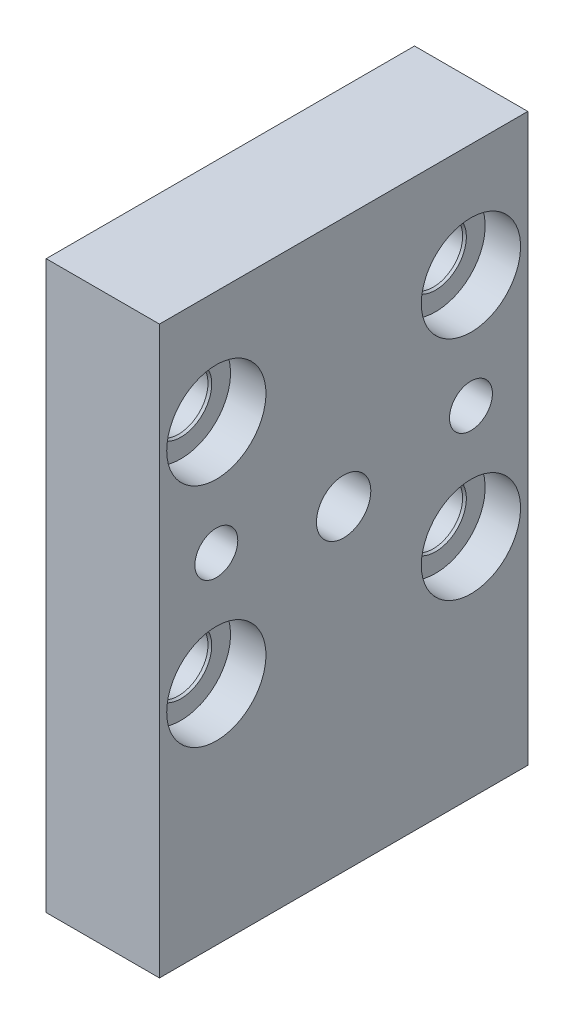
ISO-10303-21;
HEADER;
FILE_DESCRIPTION(('STEP AP214'),'2;1');
FILE_NAME('part.step','',(''),(''),'','','');
FILE_SCHEMA(('AUTOMOTIVE_DESIGN { 1 0 10303 214 1 1 1 1 }'));
ENDSEC;
DATA;
#1=APPLICATION_CONTEXT('core data for automotive mechanical design processes');
#2=APPLICATION_PROTOCOL_DEFINITION('international standard','automotive_design',2000,#1);
#3=PRODUCT_CONTEXT('',#1,'mechanical');
#4=PRODUCT('Part','Part','',(#3));
#5=PRODUCT_RELATED_PRODUCT_CATEGORY('part','',(#4));
#6=PRODUCT_DEFINITION_FORMATION('','',#4);
#7=PRODUCT_DEFINITION_CONTEXT('part definition',#1,'design');
#8=PRODUCT_DEFINITION('design','',#6,#7);
#9=PRODUCT_DEFINITION_SHAPE('','',#8);
#10=(LENGTH_UNIT() NAMED_UNIT(*) SI_UNIT(.MILLI.,.METRE.));
#11=(NAMED_UNIT(*) PLANE_ANGLE_UNIT() SI_UNIT($,.RADIAN.));
#12=(NAMED_UNIT(*) SI_UNIT($,.STERADIAN.) SOLID_ANGLE_UNIT());
#13=UNCERTAINTY_MEASURE_WITH_UNIT(LENGTH_MEASURE(1.E-05),#10,'distance_accuracy_value','');
#14=(GEOMETRIC_REPRESENTATION_CONTEXT(3) GLOBAL_UNCERTAINTY_ASSIGNED_CONTEXT((#13)) GLOBAL_UNIT_ASSIGNED_CONTEXT((#10,
#11,#12)) REPRESENTATION_CONTEXT('',''));
#15=CARTESIAN_POINT('',(0.,0.,0.));
#16=DIRECTION('',(0.,0.,1.));
#17=DIRECTION('',(1.,0.,0.));
#18=AXIS2_PLACEMENT_3D('',#15,#16,#17);
#19=CARTESIAN_POINT('',(0.,22.8346,0.));
#20=DIRECTION('',(1.,0.,0.));
#21=DIRECTION('',(0.,0.,-1.));
#22=AXIS2_PLACEMENT_3D('',#19,#20,#21);
#23=PLANE('',#22);
#24=CARTESIAN_POINT('',(0.,22.8346,0.));
#25=DIRECTION('',(-1.,0.,0.));
#26=DIRECTION('',(0.,0.,1.));
#27=AXIS2_PLACEMENT_3D('',#24,#25,#26);
#28=CIRCLE('',#27,2.032);
#29=CARTESIAN_POINT('',(0.,22.8346,2.032));
#30=VERTEX_POINT('',#29);
#31=EDGE_CURVE('E299',#30,#30,#28,.T.);
#32=ORIENTED_EDGE('',*,*,#31,.T.);
#33=EDGE_LOOP('',(#32));
#34=FACE_BOUND('',#33,.T.);
#35=DIRECTION('',(0.,-0.500000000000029,0.866025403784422));
#36=VECTOR('',#35,1.);
#37=CARTESIAN_POINT('',(0.,24.6676871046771,0.));
#38=LINE('',#37,#36);
#39=CARTESIAN_POINT('',(0.,24.6676871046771,0.));
#40=VERTEX_POINT('',#39);
#41=CARTESIAN_POINT('',(0.,23.7511435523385,1.5875));
#42=VERTEX_POINT('',#41);
#43=EDGE_CURVE('E47',#40,#42,#38,.T.);
#44=ORIENTED_EDGE('',*,*,#43,.T.);
#45=DIRECTION('',(0.,-1.,0.));
#46=VECTOR('',#45,1.);
#47=CARTESIAN_POINT('',(0.,23.7511435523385,1.5875));
#48=LINE('',#47,#46);
#49=CARTESIAN_POINT('',(0.,21.9180564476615,1.5875));
#50=VERTEX_POINT('',#49);
#51=EDGE_CURVE('E203',#42,#50,#48,.T.);
#52=ORIENTED_EDGE('',*,*,#51,.T.);
#53=DIRECTION('',(0.,-0.500000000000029,-0.866025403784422));
#54=VECTOR('',#53,1.);
#55=CARTESIAN_POINT('',(0.,21.9180564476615,1.5875));
#56=LINE('',#55,#54);
#57=CARTESIAN_POINT('',(0.,21.0015128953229,0.));
#58=VERTEX_POINT('',#57);
#59=EDGE_CURVE('E1024',#50,#58,#56,.T.);
#60=ORIENTED_EDGE('',*,*,#59,.T.);
#61=DIRECTION('',(0.,0.500000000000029,-0.866025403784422));
#62=VECTOR('',#61,1.);
#63=CARTESIAN_POINT('',(0.,21.0015128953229,0.));
#64=LINE('',#63,#62);
#65=CARTESIAN_POINT('',(0.,21.9180564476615,-1.5875));
#66=VERTEX_POINT('',#65);
#67=EDGE_CURVE('E1021',#58,#66,#64,.T.);
#68=ORIENTED_EDGE('',*,*,#67,.T.);
#69=DIRECTION('',(0.,1.,0.));
#70=VECTOR('',#69,1.);
#71=CARTESIAN_POINT('',(0.,21.9180564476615,-1.5875));
#72=LINE('',#71,#70);
#73=CARTESIAN_POINT('',(0.,23.7511435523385,-1.5875));
#74=VERTEX_POINT('',#73);
#75=EDGE_CURVE('E1015',#66,#74,#72,.T.);
#76=ORIENTED_EDGE('',*,*,#75,.T.);
#77=DIRECTION('',(0.,0.500000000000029,0.866025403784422));
#78=VECTOR('',#77,1.);
#79=CARTESIAN_POINT('',(0.,23.7511435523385,-1.5875));
#80=LINE('',#79,#78);
#81=EDGE_CURVE('E199',#74,#40,#80,.T.);
#82=ORIENTED_EDGE('',*,*,#81,.T.);
#83=EDGE_LOOP('',(#44,#52,#60,#68,#76,#82));
#84=FACE_BOUND('',#83,.T.);
#85=ADVANCED_FACE('F32',(#34,#84),#23,.F.);
#86=CARTESIAN_POINT('',(0.,28.4226,0.));
#87=DIRECTION('',(1.,0.,0.));
#88=DIRECTION('',(0.,0.,-1.));
#89=AXIS2_PLACEMENT_3D('',#86,#87,#88);
#90=PLANE('',#89);
#91=CARTESIAN_POINT('',(0.,28.4226,0.));
#92=DIRECTION('',(-1.,0.,0.));
#93=DIRECTION('',(0.,0.,1.));
#94=AXIS2_PLACEMENT_3D('',#91,#92,#93);
#95=CIRCLE('',#94,2.032);
#96=CARTESIAN_POINT('',(0.,28.4226,2.032));
#97=VERTEX_POINT('',#96);
#98=EDGE_CURVE('E305',#97,#97,#95,.T.);
#99=ORIENTED_EDGE('',*,*,#98,.T.);
#100=EDGE_LOOP('',(#99));
#101=FACE_BOUND('',#100,.T.);
#102=DIRECTION('',(0.,-0.50000000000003,0.866025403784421));
#103=VECTOR('',#102,1.);
#104=CARTESIAN_POINT('',(0.,30.2556871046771,0.));
#105=LINE('',#104,#103);
#106=CARTESIAN_POINT('',(0.,30.2556871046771,0.));
#107=VERTEX_POINT('',#106);
#108=CARTESIAN_POINT('',(0.,29.3391435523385,1.5875));
#109=VERTEX_POINT('',#108);
#110=EDGE_CURVE('E55',#107,#109,#105,.T.);
#111=ORIENTED_EDGE('',*,*,#110,.T.);
#112=DIRECTION('',(0.,-1.,0.));
#113=VECTOR('',#112,1.);
#114=CARTESIAN_POINT('',(0.,29.3391435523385,1.5875));
#115=LINE('',#114,#113);
#116=CARTESIAN_POINT('',(0.,27.5060564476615,1.5875));
#117=VERTEX_POINT('',#116);
#118=EDGE_CURVE('E206',#109,#117,#115,.T.);
#119=ORIENTED_EDGE('',*,*,#118,.T.);
#120=DIRECTION('',(0.,-0.500000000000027,-0.866025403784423));
#121=VECTOR('',#120,1.);
#122=CARTESIAN_POINT('',(0.,27.5060564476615,1.5875));
#123=LINE('',#122,#121);
#124=CARTESIAN_POINT('',(0.,26.5895128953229,0.));
#125=VERTEX_POINT('',#124);
#126=EDGE_CURVE('E229',#117,#125,#123,.T.);
#127=ORIENTED_EDGE('',*,*,#126,.T.);
#128=DIRECTION('',(0.,0.500000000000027,-0.866025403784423));
#129=VECTOR('',#128,1.);
#130=CARTESIAN_POINT('',(0.,26.5895128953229,0.));
#131=LINE('',#130,#129);
#132=CARTESIAN_POINT('',(0.,27.5060564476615,-1.5875));
#133=VERTEX_POINT('',#132);
#134=EDGE_CURVE('E232',#125,#133,#131,.T.);
#135=ORIENTED_EDGE('',*,*,#134,.T.);
#136=DIRECTION('',(0.,1.,0.));
#137=VECTOR('',#136,1.);
#138=CARTESIAN_POINT('',(0.,27.5060564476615,-1.5875));
#139=LINE('',#138,#137);
#140=CARTESIAN_POINT('',(0.,29.3391435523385,-1.5875));
#141=VERTEX_POINT('',#140);
#142=EDGE_CURVE('E235',#133,#141,#139,.T.);
#143=ORIENTED_EDGE('',*,*,#142,.T.);
#144=DIRECTION('',(0.,0.50000000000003,0.866025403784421));
#145=VECTOR('',#144,1.);
#146=CARTESIAN_POINT('',(0.,29.3391435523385,-1.5875));
#147=LINE('',#146,#145);
#148=EDGE_CURVE('E216',#141,#107,#147,.T.);
#149=ORIENTED_EDGE('',*,*,#148,.T.);
#150=EDGE_LOOP('',(#111,#119,#127,#135,#143,#149));
#151=FACE_BOUND('',#150,.T.);
#152=ADVANCED_FACE('F467',(#101,#151),#90,.F.);
#153=CARTESIAN_POINT('',(0.,7.5692,0.));
#154=DIRECTION('',(1.,0.,0.));
#155=DIRECTION('',(0.,0.,-1.));
#156=AXIS2_PLACEMENT_3D('',#153,#154,#155);
#157=PLANE('',#156);
#158=CARTESIAN_POINT('',(0.,7.5692,0.));
#159=DIRECTION('',(-1.,0.,0.));
#160=DIRECTION('',(0.,0.,1.));
#161=AXIS2_PLACEMENT_3D('',#158,#159,#160);
#162=CIRCLE('',#161,2.032);
#163=CARTESIAN_POINT('',(0.,7.5692,2.032));
#164=VERTEX_POINT('',#163);
#165=EDGE_CURVE('E311',#164,#164,#162,.T.);
#166=ORIENTED_EDGE('',*,*,#165,.T.);
#167=EDGE_LOOP('',(#166));
#168=FACE_BOUND('',#167,.T.);
#169=DIRECTION('',(0.,-0.500000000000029,0.866025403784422));
#170=VECTOR('',#169,1.);
#171=CARTESIAN_POINT('',(0.,9.4022871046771,0.));
#172=LINE('',#171,#170);
#173=CARTESIAN_POINT('',(0.,9.4022871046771,0.));
#174=VERTEX_POINT('',#173);
#175=CARTESIAN_POINT('',(0.,8.4857435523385,1.5875));
#176=VERTEX_POINT('',#175);
#177=EDGE_CURVE('E251',#174,#176,#172,.T.);
#178=ORIENTED_EDGE('',*,*,#177,.T.);
#179=DIRECTION('',(0.,-1.,0.));
#180=VECTOR('',#179,1.);
#181=CARTESIAN_POINT('',(0.,8.4857435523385,1.5875));
#182=LINE('',#181,#180);
#183=CARTESIAN_POINT('',(0.,6.6526564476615,1.5875));
#184=VERTEX_POINT('',#183);
#185=EDGE_CURVE('E269',#176,#184,#182,.T.);
#186=ORIENTED_EDGE('',*,*,#185,.T.);
#187=DIRECTION('',(0.,-0.500000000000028,-0.866025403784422));
#188=VECTOR('',#187,1.);
#189=CARTESIAN_POINT('',(0.,6.6526564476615,1.5875));
#190=LINE('',#189,#188);
#191=CARTESIAN_POINT('',(0.,5.7361128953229,0.));
#192=VERTEX_POINT('',#191);
#193=EDGE_CURVE('E272',#184,#192,#190,.T.);
#194=ORIENTED_EDGE('',*,*,#193,.T.);
#195=DIRECTION('',(0.,0.500000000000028,-0.866025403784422));
#196=VECTOR('',#195,1.);
#197=CARTESIAN_POINT('',(0.,5.7361128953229,0.));
#198=LINE('',#197,#196);
#199=CARTESIAN_POINT('',(0.,6.6526564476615,-1.5875));
#200=VERTEX_POINT('',#199);
#201=EDGE_CURVE('E275',#192,#200,#198,.T.);
#202=ORIENTED_EDGE('',*,*,#201,.T.);
#203=DIRECTION('',(0.,1.,0.));
#204=VECTOR('',#203,1.);
#205=CARTESIAN_POINT('',(0.,6.6526564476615,-1.5875));
#206=LINE('',#205,#204);
#207=CARTESIAN_POINT('',(0.,8.4857435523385,-1.5875));
#208=VERTEX_POINT('',#207);
#209=EDGE_CURVE('E278',#200,#208,#206,.T.);
#210=ORIENTED_EDGE('',*,*,#209,.T.);
#211=DIRECTION('',(0.,0.500000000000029,0.866025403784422));
#212=VECTOR('',#211,1.);
#213=CARTESIAN_POINT('',(0.,8.4857435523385,-1.5875));
#214=LINE('',#213,#212);
#215=EDGE_CURVE('E256',#208,#174,#214,.T.);
#216=ORIENTED_EDGE('',*,*,#215,.T.);
#217=EDGE_LOOP('',(#178,#186,#194,#202,#210,#216));
#218=FACE_BOUND('',#217,.T.);
#219=ADVANCED_FACE('F460',(#168,#218),#157,.F.);
#220=CARTESIAN_POINT('',(3.175,22.8346,0.));
#221=DIRECTION('',(1.,0.,0.));
#222=DIRECTION('',(0.,0.,-1.));
#223=AXIS2_PLACEMENT_3D('',#220,#221,#222);
#224=PLANE('',#223);
#225=CARTESIAN_POINT('',(3.175,22.8346,0.));
#226=DIRECTION('',(1.,0.,0.));
#227=DIRECTION('',(0.,0.,-1.));
#228=AXIS2_PLACEMENT_3D('',#225,#226,#227);
#229=CIRCLE('',#228,2.7432);
#230=CARTESIAN_POINT('',(3.175,22.8346,-2.7432));
#231=VERTEX_POINT('',#230);
#232=EDGE_CURVE('E321',#231,#231,#229,.T.);
#233=ORIENTED_EDGE('',*,*,#232,.F.);
#234=EDGE_LOOP('',(#233));
#235=FACE_BOUND('',#234,.T.);
#236=CARTESIAN_POINT('',(3.175,22.8346,0.));
#237=DIRECTION('',(1.,0.,0.));
#238=DIRECTION('',(0.,0.,-1.));
#239=AXIS2_PLACEMENT_3D('',#236,#237,#238);
#240=CIRCLE('',#239,2.54);
#241=CARTESIAN_POINT('',(3.175,22.8346,-2.54));
#242=VERTEX_POINT('',#241);
#243=EDGE_CURVE('E11',#242,#242,#240,.F.);
#244=ORIENTED_EDGE('',*,*,#243,.F.);
#245=EDGE_LOOP('',(#244));
#246=FACE_BOUND('',#245,.T.);
#247=ADVANCED_FACE('F450',(#235,#246),#224,.F.);
#248=CARTESIAN_POINT('',(3.175,28.4226,0.));
#249=DIRECTION('',(1.,0.,0.));
#250=DIRECTION('',(0.,0.,-1.));
#251=AXIS2_PLACEMENT_3D('',#248,#249,#250);
#252=PLANE('',#251);
#253=CARTESIAN_POINT('',(3.175,28.4226,0.));
#254=DIRECTION('',(1.,0.,0.));
#255=DIRECTION('',(0.,0.,-1.));
#256=AXIS2_PLACEMENT_3D('',#253,#254,#255);
#257=CIRCLE('',#256,2.7432);
#258=CARTESIAN_POINT('',(3.175,28.4226,-2.7432));
#259=VERTEX_POINT('',#258);
#260=EDGE_CURVE('E315',#259,#259,#257,.T.);
#261=ORIENTED_EDGE('',*,*,#260,.F.);
#262=EDGE_LOOP('',(#261));
#263=FACE_BOUND('',#262,.T.);
#264=CARTESIAN_POINT('',(3.175,28.4226,0.));
#265=DIRECTION('',(1.,0.,0.));
#266=DIRECTION('',(0.,0.,-1.));
#267=AXIS2_PLACEMENT_3D('',#264,#265,#266);
#268=CIRCLE('',#267,2.54);
#269=CARTESIAN_POINT('',(3.175,28.4226,-2.54));
#270=VERTEX_POINT('',#269);
#271=EDGE_CURVE('E40',#270,#270,#268,.F.);
#272=ORIENTED_EDGE('',*,*,#271,.F.);
#273=EDGE_LOOP('',(#272));
#274=FACE_BOUND('',#273,.T.);
#275=ADVANCED_FACE('F447',(#263,#274),#252,.F.);
#276=CARTESIAN_POINT('',(3.175,7.5692,0.));
#277=DIRECTION('',(1.,0.,0.));
#278=DIRECTION('',(0.,0.,-1.));
#279=AXIS2_PLACEMENT_3D('',#276,#277,#278);
#280=PLANE('',#279);
#281=CARTESIAN_POINT('',(3.175,7.5692,0.));
#282=DIRECTION('',(1.,0.,0.));
#283=DIRECTION('',(0.,0.,-1.));
#284=AXIS2_PLACEMENT_3D('',#281,#282,#283);
#285=CIRCLE('',#284,2.7432);
#286=CARTESIAN_POINT('',(3.175,7.5692,-2.7432));
#287=VERTEX_POINT('',#286);
#288=EDGE_CURVE('E327',#287,#287,#285,.T.);
#289=ORIENTED_EDGE('',*,*,#288,.F.);
#290=EDGE_LOOP('',(#289));
#291=FACE_BOUND('',#290,.T.);
#292=CARTESIAN_POINT('',(3.175,7.5692,0.));
#293=DIRECTION('',(1.,0.,0.));
#294=DIRECTION('',(0.,0.,-1.));
#295=AXIS2_PLACEMENT_3D('',#292,#293,#294);
#296=CIRCLE('',#295,2.54);
#297=CARTESIAN_POINT('',(3.175,7.5692,-2.54));
#298=VERTEX_POINT('',#297);
#299=EDGE_CURVE('E440',#298,#298,#296,.F.);
#300=ORIENTED_EDGE('',*,*,#299,.F.);
#301=EDGE_LOOP('',(#300));
#302=FACE_BOUND('',#301,.T.);
#303=ADVANCED_FACE('F449',(#291,#302),#280,.F.);
#304=CARTESIAN_POINT('',(0.,0.,10.3251));
#305=DIRECTION('',(1.,0.,0.));
#306=DIRECTION('',(0.,0.,-1.));
#307=AXIS2_PLACEMENT_3D('',#304,#305,#306);
#308=PLANE('',#307);
#309=CARTESIAN_POINT('',(0.,22.8346,0.));
#310=DIRECTION('',(1.,0.,0.));
#311=DIRECTION('',(0.,0.,-1.));
#312=AXIS2_PLACEMENT_3D('',#309,#310,#311);
#313=CIRCLE('',#312,2.7432);
#314=CARTESIAN_POINT('',(0.,22.8346,-2.7432));
#315=VERTEX_POINT('',#314);
#316=EDGE_CURVE('E318',#315,#315,#313,.T.);
#317=ORIENTED_EDGE('',*,*,#316,.T.);
#318=EDGE_LOOP('',(#317));
#319=FACE_BOUND('',#318,.T.);
#320=CARTESIAN_POINT('',(0.,25.4,-7.1374));
#321=DIRECTION('',(-1.,0.,0.));
#322=DIRECTION('',(0.,0.,1.));
#323=AXIS2_PLACEMENT_3D('',#320,#321,#322);
#324=CIRCLE('',#323,1.651);
#325=CARTESIAN_POINT('',(0.,25.4,-5.4864));
#326=VERTEX_POINT('',#325);
#327=EDGE_CURVE('E344',#326,#326,#324,.T.);
#328=ORIENTED_EDGE('',*,*,#327,.F.);
#329=EDGE_LOOP('',(#328));
#330=FACE_BOUND('',#329,.T.);
#331=CARTESIAN_POINT('',(0.,12.7,-7.1374));
#332=DIRECTION('',(-1.,0.,0.));
#333=DIRECTION('',(0.,0.,1.));
#334=AXIS2_PLACEMENT_3D('',#331,#332,#333);
#335=CIRCLE('',#334,1.651);
#336=CARTESIAN_POINT('',(0.,12.7,-5.4864));
#337=VERTEX_POINT('',#336);
#338=EDGE_CURVE('E374',#337,#337,#335,.T.);
#339=ORIENTED_EDGE('',*,*,#338,.F.);
#340=EDGE_LOOP('',(#339));
#341=FACE_BOUND('',#340,.T.);
#342=CARTESIAN_POINT('',(0.,19.05,7.1374));
#343=DIRECTION('',(1.,0.,0.));
#344=DIRECTION('',(0.,0.,-1.));
#345=AXIS2_PLACEMENT_3D('',#342,#343,#344);
#346=CIRCLE('',#345,1.20269);
#347=CARTESIAN_POINT('',(0.,19.05,5.93471));
#348=VERTEX_POINT('',#347);
#349=EDGE_CURVE('E392',#348,#348,#346,.T.);
#350=ORIENTED_EDGE('',*,*,#349,.T.);
#351=EDGE_LOOP('',(#350));
#352=FACE_BOUND('',#351,.T.);
#353=CARTESIAN_POINT('',(0.,19.05,-7.1374));
#354=DIRECTION('',(1.,0.,0.));
#355=DIRECTION('',(0.,0.,-1.));
#356=AXIS2_PLACEMENT_3D('',#353,#354,#355);
#357=CIRCLE('',#356,1.20269);
#358=CARTESIAN_POINT('',(0.,19.05,-8.34009));
#359=VERTEX_POINT('',#358);
#360=EDGE_CURVE('E402',#359,#359,#357,.T.);
#361=ORIENTED_EDGE('',*,*,#360,.T.);
#362=EDGE_LOOP('',(#361));
#363=FACE_BOUND('',#362,.T.);
#364=DIRECTION('',(0.,-1.,0.));
#365=VECTOR('',#364,1.);
#366=CARTESIAN_POINT('',(0.,31.75,10.3251));
#367=LINE('',#366,#365);
#368=CARTESIAN_POINT('',(0.,31.75,10.3251));
#369=VERTEX_POINT('',#368);
#370=CARTESIAN_POINT('',(0.,0.,10.3251));
#371=VERTEX_POINT('',#370);
#372=EDGE_CURVE('E408',#369,#371,#367,.T.);
#373=ORIENTED_EDGE('',*,*,#372,.F.);
#374=DIRECTION('',(0.,0.,1.));
#375=VECTOR('',#374,1.);
#376=CARTESIAN_POINT('',(0.,31.75,-10.3251));
#377=LINE('',#376,#375);
#378=CARTESIAN_POINT('',(0.,31.75,-10.3251));
#379=VERTEX_POINT('',#378);
#380=EDGE_CURVE('E415',#379,#369,#377,.T.);
#381=ORIENTED_EDGE('',*,*,#380,.F.);
#382=DIRECTION('',(0.,1.,0.));
#383=VECTOR('',#382,1.);
#384=CARTESIAN_POINT('',(0.,0.,-10.3251));
#385=LINE('',#384,#383);
#386=CARTESIAN_POINT('',(0.,0.,-10.3251));
#387=VERTEX_POINT('',#386);
#388=EDGE_CURVE('E426',#387,#379,#385,.T.);
#389=ORIENTED_EDGE('',*,*,#388,.F.);
#390=DIRECTION('',(0.,0.,-1.));
#391=VECTOR('',#390,1.);
#392=CARTESIAN_POINT('',(0.,0.,10.3251));
#393=LINE('',#392,#391);
#394=EDGE_CURVE('E424',#371,#387,#393,.T.);
#395=ORIENTED_EDGE('',*,*,#394,.F.);
#396=EDGE_LOOP('',(#373,#381,#389,#395));
#397=FACE_BOUND('',#396,.T.);
#398=CARTESIAN_POINT('',(0.,17.7292,0.));
#399=DIRECTION('',(1.,0.,0.));
#400=DIRECTION('',(0.,0.,-1.));
#401=AXIS2_PLACEMENT_3D('',#398,#399,#400);
#402=CIRCLE('',#401,1.524);
#403=CARTESIAN_POINT('',(0.,17.7292,-1.524));
#404=VERTEX_POINT('',#403);
#405=EDGE_CURVE('E396',#404,#404,#402,.T.);
#406=ORIENTED_EDGE('',*,*,#405,.T.);
#407=EDGE_LOOP('',(#406));
#408=FACE_BOUND('',#407,.T.);
#409=CARTESIAN_POINT('',(0.,25.4,7.1374));
#410=DIRECTION('',(-1.,0.,0.));
#411=DIRECTION('',(0.,0.,1.));
#412=AXIS2_PLACEMENT_3D('',#409,#410,#411);
#413=CIRCLE('',#412,1.651);
#414=CARTESIAN_POINT('',(0.,25.4,8.7884));
#415=VERTEX_POINT('',#414);
#416=EDGE_CURVE('E389',#415,#415,#413,.T.);
#417=ORIENTED_EDGE('',*,*,#416,.F.);
#418=EDGE_LOOP('',(#417));
#419=FACE_BOUND('',#418,.T.);
#420=CARTESIAN_POINT('',(0.,12.7,7.1374));
#421=DIRECTION('',(-1.,0.,0.));
#422=DIRECTION('',(0.,0.,1.));
#423=AXIS2_PLACEMENT_3D('',#420,#421,#422);
#424=CIRCLE('',#423,1.651);
#425=CARTESIAN_POINT('',(0.,12.7,8.7884));
#426=VERTEX_POINT('',#425);
#427=EDGE_CURVE('E359',#426,#426,#424,.T.);
#428=ORIENTED_EDGE('',*,*,#427,.F.);
#429=EDGE_LOOP('',(#428));
#430=FACE_BOUND('',#429,.T.);
#431=CARTESIAN_POINT('',(0.,7.5692,0.));
#432=DIRECTION('',(1.,0.,0.));
#433=DIRECTION('',(0.,0.,-1.));
#434=AXIS2_PLACEMENT_3D('',#431,#432,#433);
#435=CIRCLE('',#434,2.7432);
#436=CARTESIAN_POINT('',(0.,7.5692,-2.7432));
#437=VERTEX_POINT('',#436);
#438=EDGE_CURVE('E324',#437,#437,#435,.T.);
#439=ORIENTED_EDGE('',*,*,#438,.T.);
#440=EDGE_LOOP('',(#439));
#441=FACE_BOUND('',#440,.T.);
#442=CARTESIAN_POINT('',(0.,28.4226,0.));
#443=DIRECTION('',(1.,0.,0.));
#444=DIRECTION('',(0.,0.,-1.));
#445=AXIS2_PLACEMENT_3D('',#442,#443,#444);
#446=CIRCLE('',#445,2.7432);
#447=CARTESIAN_POINT('',(0.,28.4226,-2.7432));
#448=VERTEX_POINT('',#447);
#449=EDGE_CURVE('E314',#448,#448,#446,.T.);
#450=ORIENTED_EDGE('',*,*,#449,.T.);
#451=EDGE_LOOP('',(#450));
#452=FACE_BOUND('',#451,.T.);
#453=ADVANCED_FACE('F457',(#319,#330,#341,#352,#363,#397,#408,#419,#430,#441,#452),#308,.F.);
#454=CARTESIAN_POINT('',(6.35,0.,10.3251));
#455=DIRECTION('',(1.,0.,0.));
#456=DIRECTION('',(0.,0.,-1.));
#457=AXIS2_PLACEMENT_3D('',#454,#455,#456);
#458=PLANE('',#457);
#459=CARTESIAN_POINT('',(6.35,12.7,7.1374));
#460=DIRECTION('',(-1.,0.,0.));
#461=DIRECTION('',(0.,0.,1.));
#462=AXIS2_PLACEMENT_3D('',#459,#460,#461);
#463=CIRCLE('',#462,2.7813);
#464=CARTESIAN_POINT('',(6.35,12.7,9.9187));
#465=VERTEX_POINT('',#464);
#466=EDGE_CURVE('E347',#465,#465,#463,.T.);
#467=ORIENTED_EDGE('',*,*,#466,.T.);
#468=EDGE_LOOP('',(#467));
#469=FACE_BOUND('',#468,.T.);
#470=CARTESIAN_POINT('',(6.35,25.4,7.1374));
#471=DIRECTION('',(-1.,0.,0.));
#472=DIRECTION('',(0.,0.,1.));
#473=AXIS2_PLACEMENT_3D('',#470,#471,#472);
#474=CIRCLE('',#473,2.7813);
#475=CARTESIAN_POINT('',(6.35,25.4,9.9187));
#476=VERTEX_POINT('',#475);
#477=EDGE_CURVE('E377',#476,#476,#474,.T.);
#478=ORIENTED_EDGE('',*,*,#477,.T.);
#479=EDGE_LOOP('',(#478));
#480=FACE_BOUND('',#479,.T.);
#481=CARTESIAN_POINT('',(6.35,17.7292,0.));
#482=DIRECTION('',(1.,0.,0.));
#483=DIRECTION('',(0.,0.,-1.));
#484=AXIS2_PLACEMENT_3D('',#481,#482,#483);
#485=CIRCLE('',#484,1.524);
#486=CARTESIAN_POINT('',(6.35,17.7292,-1.524));
#487=VERTEX_POINT('',#486);
#488=EDGE_CURVE('E399',#487,#487,#485,.T.);
#489=ORIENTED_EDGE('',*,*,#488,.F.);
#490=EDGE_LOOP('',(#489));
#491=FACE_BOUND('',#490,.T.);
#492=DIRECTION('',(0.,-1.,0.));
#493=VECTOR('',#492,1.);
#494=CARTESIAN_POINT('',(6.35,31.75,10.3251));
#495=LINE('',#494,#493);
#496=CARTESIAN_POINT('',(6.35,31.75,10.3251));
#497=VERTEX_POINT('',#496);
#498=CARTESIAN_POINT('',(6.35,0.,10.3251));
#499=VERTEX_POINT('',#498);
#500=EDGE_CURVE('E411',#497,#499,#495,.T.);
#501=ORIENTED_EDGE('',*,*,#500,.T.);
#502=DIRECTION('',(0.,0.,-1.));
#503=VECTOR('',#502,1.);
#504=CARTESIAN_POINT('',(6.35,0.,10.3251));
#505=LINE('',#504,#503);
#506=CARTESIAN_POINT('',(6.35,0.,-10.3251));
#507=VERTEX_POINT('',#506);
#508=EDGE_CURVE('E414',#499,#507,#505,.T.);
#509=ORIENTED_EDGE('',*,*,#508,.T.);
#510=DIRECTION('',(0.,1.,0.));
#511=VECTOR('',#510,1.);
#512=CARTESIAN_POINT('',(6.35,0.,-10.3251));
#513=LINE('',#512,#511);
#514=CARTESIAN_POINT('',(6.35,31.75,-10.3251));
#515=VERTEX_POINT('',#514);
#516=EDGE_CURVE('E417',#507,#515,#513,.T.);
#517=ORIENTED_EDGE('',*,*,#516,.T.);
#518=DIRECTION('',(0.,0.,1.));
#519=VECTOR('',#518,1.);
#520=CARTESIAN_POINT('',(6.35,31.75,-10.3251));
#521=LINE('',#520,#519);
#522=EDGE_CURVE('E419',#515,#497,#521,.T.);
#523=ORIENTED_EDGE('',*,*,#522,.T.);
#524=EDGE_LOOP('',(#501,#509,#517,#523));
#525=FACE_BOUND('',#524,.T.);
#526=CARTESIAN_POINT('',(6.35,19.05,-7.1374));
#527=DIRECTION('',(1.,0.,0.));
#528=DIRECTION('',(0.,0.,-1.));
#529=AXIS2_PLACEMENT_3D('',#526,#527,#528);
#530=CIRCLE('',#529,1.20269);
#531=CARTESIAN_POINT('',(6.35,19.05,-8.34009));
#532=VERTEX_POINT('',#531);
#533=EDGE_CURVE('E405',#532,#532,#530,.T.);
#534=ORIENTED_EDGE('',*,*,#533,.F.);
#535=EDGE_LOOP('',(#534));
#536=FACE_BOUND('',#535,.T.);
#537=CARTESIAN_POINT('',(6.35,19.05,7.1374));
#538=DIRECTION('',(1.,0.,0.));
#539=DIRECTION('',(0.,0.,-1.));
#540=AXIS2_PLACEMENT_3D('',#537,#538,#539);
#541=CIRCLE('',#540,1.20269);
#542=CARTESIAN_POINT('',(6.35,19.05,5.93471));
#543=VERTEX_POINT('',#542);
#544=EDGE_CURVE('E393',#543,#543,#541,.T.);
#545=ORIENTED_EDGE('',*,*,#544,.F.);
#546=EDGE_LOOP('',(#545));
#547=FACE_BOUND('',#546,.T.);
#548=CARTESIAN_POINT('',(6.35,12.7,-7.1374));
#549=DIRECTION('',(-1.,0.,0.));
#550=DIRECTION('',(0.,0.,1.));
#551=AXIS2_PLACEMENT_3D('',#548,#549,#550);
#552=CIRCLE('',#551,2.7813);
#553=CARTESIAN_POINT('',(6.35,12.7,-4.3561));
#554=VERTEX_POINT('',#553);
#555=EDGE_CURVE('E362',#554,#554,#552,.T.);
#556=ORIENTED_EDGE('',*,*,#555,.T.);
#557=EDGE_LOOP('',(#556));
#558=FACE_BOUND('',#557,.T.);
#559=CARTESIAN_POINT('',(6.35,25.4,-7.1374));
#560=DIRECTION('',(-1.,0.,0.));
#561=DIRECTION('',(0.,0.,1.));
#562=AXIS2_PLACEMENT_3D('',#559,#560,#561);
#563=CIRCLE('',#562,2.7813);
#564=CARTESIAN_POINT('',(6.35,25.4,-4.3561));
#565=VERTEX_POINT('',#564);
#566=EDGE_CURVE('E330',#565,#565,#563,.T.);
#567=ORIENTED_EDGE('',*,*,#566,.T.);
#568=EDGE_LOOP('',(#567));
#569=FACE_BOUND('',#568,.T.);
#570=ADVANCED_FACE('F783',(#469,#480,#491,#525,#536,#547,#558,#569),#458,.T.);
#571=CARTESIAN_POINT('',(6.35,31.75,10.3251));
#572=DIRECTION('',(0.,0.,-1.));
#573=DIRECTION('',(-1.,0.,0.));
#574=AXIS2_PLACEMENT_3D('',#571,#572,#573);
#575=PLANE('',#574);
#576=ORIENTED_EDGE('',*,*,#372,.T.);
#577=DIRECTION('',(-1.,0.,0.));
#578=VECTOR('',#577,1.);
#579=CARTESIAN_POINT('',(6.35,0.,10.3251));
#580=LINE('',#579,#578);
#581=EDGE_CURVE('E437',#499,#371,#580,.T.);
#582=ORIENTED_EDGE('',*,*,#581,.F.);
#583=ORIENTED_EDGE('',*,*,#500,.F.);
#584=DIRECTION('',(-1.,0.,0.));
#585=VECTOR('',#584,1.);
#586=CARTESIAN_POINT('',(6.35,31.75,10.3251));
#587=LINE('',#586,#585);
#588=EDGE_CURVE('E421',#497,#369,#587,.T.);
#589=ORIENTED_EDGE('',*,*,#588,.T.);
#590=EDGE_LOOP('',(#576,#582,#583,#589));
#591=FACE_BOUND('',#590,.T.);
#592=ADVANCED_FACE('F34',(#591),#575,.F.);
#593=CARTESIAN_POINT('',(6.35,0.,10.3251));
#594=DIRECTION('',(0.,1.,0.));
#595=DIRECTION('',(0.,0.,1.));
#596=AXIS2_PLACEMENT_3D('',#593,#594,#595);
#597=PLANE('',#596);
#598=ORIENTED_EDGE('',*,*,#394,.T.);
#599=DIRECTION('',(-1.,0.,0.));
#600=VECTOR('',#599,1.);
#601=CARTESIAN_POINT('',(6.35,0.,-10.3251));
#602=LINE('',#601,#600);
#603=EDGE_CURVE('E434',#507,#387,#602,.T.);
#604=ORIENTED_EDGE('',*,*,#603,.F.);
#605=ORIENTED_EDGE('',*,*,#508,.F.);
#606=ORIENTED_EDGE('',*,*,#581,.T.);
#607=EDGE_LOOP('',(#598,#604,#605,#606));
#608=FACE_BOUND('',#607,.T.);
#609=ADVANCED_FACE('F769',(#608),#597,.F.);
#610=CARTESIAN_POINT('',(6.35,0.,-10.3251));
#611=DIRECTION('',(0.,0.,1.));
#612=DIRECTION('',(1.,0.,0.));
#613=AXIS2_PLACEMENT_3D('',#610,#611,#612);
#614=PLANE('',#613);
#615=ORIENTED_EDGE('',*,*,#388,.T.);
#616=DIRECTION('',(-1.,0.,0.));
#617=VECTOR('',#616,1.);
#618=CARTESIAN_POINT('',(6.35,31.75,-10.3251));
#619=LINE('',#618,#617);
#620=EDGE_CURVE('E431',#515,#379,#619,.T.);
#621=ORIENTED_EDGE('',*,*,#620,.F.);
#622=ORIENTED_EDGE('',*,*,#516,.F.);
#623=ORIENTED_EDGE('',*,*,#603,.T.);
#624=EDGE_LOOP('',(#615,#621,#622,#623));
#625=FACE_BOUND('',#624,.T.);
#626=ADVANCED_FACE('F761',(#625),#614,.F.);
#627=CARTESIAN_POINT('',(6.35,31.75,-10.3251));
#628=DIRECTION('',(0.,-1.,0.));
#629=DIRECTION('',(0.,0.,-1.));
#630=AXIS2_PLACEMENT_3D('',#627,#628,#629);
#631=PLANE('',#630);
#632=ORIENTED_EDGE('',*,*,#380,.T.);
#633=ORIENTED_EDGE('',*,*,#588,.F.);
#634=ORIENTED_EDGE('',*,*,#522,.F.);
#635=ORIENTED_EDGE('',*,*,#620,.T.);
#636=EDGE_LOOP('',(#632,#633,#634,#635));
#637=FACE_BOUND('',#636,.T.);
#638=ADVANCED_FACE('F753',(#637),#631,.F.);
#639=CARTESIAN_POINT('',(6.35,19.05,-7.1374));
#640=DIRECTION('',(-1.,0.,0.));
#641=DIRECTION('',(0.,0.,1.));
#642=AXIS2_PLACEMENT_3D('',#639,#640,#641);
#643=CYLINDRICAL_SURFACE('',#642,1.20269);
#644=ORIENTED_EDGE('',*,*,#533,.T.);
#645=EDGE_LOOP('',(#644));
#646=FACE_BOUND('',#645,.T.);
#647=ORIENTED_EDGE('',*,*,#360,.F.);
#648=EDGE_LOOP('',(#647));
#649=FACE_BOUND('',#648,.T.);
#650=ADVANCED_FACE('F745',(#646,#649),#643,.F.);
#651=CARTESIAN_POINT('',(6.35,17.7292,0.));
#652=DIRECTION('',(-1.,0.,0.));
#653=DIRECTION('',(0.,0.,1.));
#654=AXIS2_PLACEMENT_3D('',#651,#652,#653);
#655=CYLINDRICAL_SURFACE('',#654,1.524);
#656=ORIENTED_EDGE('',*,*,#488,.T.);
#657=EDGE_LOOP('',(#656));
#658=FACE_BOUND('',#657,.T.);
#659=ORIENTED_EDGE('',*,*,#405,.F.);
#660=EDGE_LOOP('',(#659));
#661=FACE_BOUND('',#660,.T.);
#662=ADVANCED_FACE('F737',(#658,#661),#655,.F.);
#663=CARTESIAN_POINT('',(6.35,19.05,7.1374));
#664=DIRECTION('',(-1.,0.,0.));
#665=DIRECTION('',(0.,0.,1.));
#666=AXIS2_PLACEMENT_3D('',#663,#664,#665);
#667=CYLINDRICAL_SURFACE('',#666,1.20269);
#668=ORIENTED_EDGE('',*,*,#544,.T.);
#669=EDGE_LOOP('',(#668));
#670=FACE_BOUND('',#669,.T.);
#671=ORIENTED_EDGE('',*,*,#349,.F.);
#672=EDGE_LOOP('',(#671));
#673=FACE_BOUND('',#672,.T.);
#674=ADVANCED_FACE('F729',(#670,#673),#667,.F.);
#675=CARTESIAN_POINT('',(6.35,25.4,7.1374));
#676=DIRECTION('',(-1.,0.,0.));
#677=DIRECTION('',(0.,0.,1.));
#678=AXIS2_PLACEMENT_3D('',#675,#676,#677);
#679=CYLINDRICAL_SURFACE('',#678,1.651);
#680=ORIENTED_EDGE('',*,*,#416,.T.);
#681=EDGE_LOOP('',(#680));
#682=FACE_BOUND('',#681,.T.);
#683=CARTESIAN_POINT('',(4.2333333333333,25.4,7.1374));
#684=DIRECTION('',(-1.,0.,0.));
#685=DIRECTION('',(0.,0.,1.));
#686=AXIS2_PLACEMENT_3D('',#683,#684,#685);
#687=CIRCLE('',#686,1.651);
#688=CARTESIAN_POINT('',(4.2333333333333,25.4,8.7884));
#689=VERTEX_POINT('',#688);
#690=EDGE_CURVE('E386',#689,#689,#687,.T.);
#691=ORIENTED_EDGE('',*,*,#690,.F.);
#692=EDGE_LOOP('',(#691));
#693=FACE_BOUND('',#692,.T.);
#694=ADVANCED_FACE('F721',(#682,#693),#679,.F.);
#695=CARTESIAN_POINT('',(4.3653156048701,25.4,7.1374));
#696=DIRECTION('',(1.,0.,0.));
#697=DIRECTION('',(0.,0.,-1.));
#698=AXIS2_PLACEMENT_3D('',#695,#696,#697);
#699=CONICAL_SURFACE('',#698,1.7272,0.523598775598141);
#700=ORIENTED_EDGE('',*,*,#690,.T.);
#701=EDGE_LOOP('',(#700));
#702=FACE_BOUND('',#701,.T.);
#703=CARTESIAN_POINT('',(4.3653156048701,25.4,7.1374));
#704=DIRECTION('',(-1.,0.,0.));
#705=DIRECTION('',(0.,0.,1.));
#706=AXIS2_PLACEMENT_3D('',#703,#704,#705);
#707=CIRCLE('',#706,1.7272);
#708=CARTESIAN_POINT('',(4.3653156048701,25.4,8.8646));
#709=VERTEX_POINT('',#708);
#710=EDGE_CURVE('E383',#709,#709,#707,.T.);
#711=ORIENTED_EDGE('',*,*,#710,.F.);
#712=EDGE_LOOP('',(#711));
#713=FACE_BOUND('',#712,.T.);
#714=ADVANCED_FACE('F713',(#702,#713),#699,.F.);
#715=CARTESIAN_POINT('',(4.3653156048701,27.1272,7.1374));
#716=DIRECTION('',(1.,0.,0.));
#717=DIRECTION('',(0.,0.,-1.));
#718=AXIS2_PLACEMENT_3D('',#715,#716,#717);
#719=PLANE('',#718);
#720=ORIENTED_EDGE('',*,*,#710,.T.);
#721=EDGE_LOOP('',(#720));
#722=FACE_BOUND('',#721,.T.);
#723=CARTESIAN_POINT('',(4.3653156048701,25.4,7.1374));
#724=DIRECTION('',(-1.,0.,0.));
#725=DIRECTION('',(0.,0.,1.));
#726=AXIS2_PLACEMENT_3D('',#723,#724,#725);
#727=CIRCLE('',#726,2.7813);
#728=CARTESIAN_POINT('',(4.3653156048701,25.4,9.9187));
#729=VERTEX_POINT('',#728);
#730=EDGE_CURVE('E380',#729,#729,#727,.T.);
#731=ORIENTED_EDGE('',*,*,#730,.F.);
#732=EDGE_LOOP('',(#731));
#733=FACE_BOUND('',#732,.T.);
#734=ADVANCED_FACE('F705',(#722,#733),#719,.T.);
#735=CARTESIAN_POINT('',(6.35,25.4,7.1374));
#736=DIRECTION('',(-1.,0.,0.));
#737=DIRECTION('',(0.,0.,1.));
#738=AXIS2_PLACEMENT_3D('',#735,#736,#737);
#739=CYLINDRICAL_SURFACE('',#738,2.7813);
#740=ORIENTED_EDGE('',*,*,#730,.T.);
#741=EDGE_LOOP('',(#740));
#742=FACE_BOUND('',#741,.T.);
#743=ORIENTED_EDGE('',*,*,#477,.F.);
#744=EDGE_LOOP('',(#743));
#745=FACE_BOUND('',#744,.T.);
#746=ADVANCED_FACE('F697',(#742,#745),#739,.F.);
#747=CARTESIAN_POINT('',(6.35,12.7,-7.1374));
#748=DIRECTION('',(-1.,0.,0.));
#749=DIRECTION('',(0.,0.,1.));
#750=AXIS2_PLACEMENT_3D('',#747,#748,#749);
#751=CYLINDRICAL_SURFACE('',#750,1.651);
#752=ORIENTED_EDGE('',*,*,#338,.T.);
#753=EDGE_LOOP('',(#752));
#754=FACE_BOUND('',#753,.T.);
#755=CARTESIAN_POINT('',(4.2333333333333,12.7,-7.1374));
#756=DIRECTION('',(-1.,0.,0.));
#757=DIRECTION('',(0.,0.,1.));
#758=AXIS2_PLACEMENT_3D('',#755,#756,#757);
#759=CIRCLE('',#758,1.651);
#760=CARTESIAN_POINT('',(4.2333333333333,12.7,-5.4864));
#761=VERTEX_POINT('',#760);
#762=EDGE_CURVE('E371',#761,#761,#759,.T.);
#763=ORIENTED_EDGE('',*,*,#762,.F.);
#764=EDGE_LOOP('',(#763));
#765=FACE_BOUND('',#764,.T.);
#766=ADVANCED_FACE('F689',(#754,#765),#751,.F.);
#767=CARTESIAN_POINT('',(4.3653156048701,12.7,-7.1374));
#768=DIRECTION('',(1.,0.,0.));
#769=DIRECTION('',(0.,0.,-1.));
#770=AXIS2_PLACEMENT_3D('',#767,#768,#769);
#771=CONICAL_SURFACE('',#770,1.7272,0.523598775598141);
#772=ORIENTED_EDGE('',*,*,#762,.T.);
#773=EDGE_LOOP('',(#772));
#774=FACE_BOUND('',#773,.T.);
#775=CARTESIAN_POINT('',(4.3653156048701,12.7,-7.1374));
#776=DIRECTION('',(-1.,0.,0.));
#777=DIRECTION('',(0.,0.,1.));
#778=AXIS2_PLACEMENT_3D('',#775,#776,#777);
#779=CIRCLE('',#778,1.7272);
#780=CARTESIAN_POINT('',(4.3653156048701,12.7,-5.4102));
#781=VERTEX_POINT('',#780);
#782=EDGE_CURVE('E368',#781,#781,#779,.T.);
#783=ORIENTED_EDGE('',*,*,#782,.F.);
#784=EDGE_LOOP('',(#783));
#785=FACE_BOUND('',#784,.T.);
#786=ADVANCED_FACE('F681',(#774,#785),#771,.F.);
#787=CARTESIAN_POINT('',(4.3653156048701,14.4272,-7.1374));
#788=DIRECTION('',(1.,0.,0.));
#789=DIRECTION('',(0.,0.,-1.));
#790=AXIS2_PLACEMENT_3D('',#787,#788,#789);
#791=PLANE('',#790);
#792=ORIENTED_EDGE('',*,*,#782,.T.);
#793=EDGE_LOOP('',(#792));
#794=FACE_BOUND('',#793,.T.);
#795=CARTESIAN_POINT('',(4.3653156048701,12.7,-7.1374));
#796=DIRECTION('',(-1.,0.,0.));
#797=DIRECTION('',(0.,0.,1.));
#798=AXIS2_PLACEMENT_3D('',#795,#796,#797);
#799=CIRCLE('',#798,2.7813);
#800=CARTESIAN_POINT('',(4.3653156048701,12.7,-4.3561));
#801=VERTEX_POINT('',#800);
#802=EDGE_CURVE('E365',#801,#801,#799,.T.);
#803=ORIENTED_EDGE('',*,*,#802,.F.);
#804=EDGE_LOOP('',(#803));
#805=FACE_BOUND('',#804,.T.);
#806=ADVANCED_FACE('F673',(#794,#805),#791,.T.);
#807=CARTESIAN_POINT('',(6.35,12.7,-7.1374));
#808=DIRECTION('',(-1.,0.,0.));
#809=DIRECTION('',(0.,0.,1.));
#810=AXIS2_PLACEMENT_3D('',#807,#808,#809);
#811=CYLINDRICAL_SURFACE('',#810,2.7813);
#812=ORIENTED_EDGE('',*,*,#802,.T.);
#813=EDGE_LOOP('',(#812));
#814=FACE_BOUND('',#813,.T.);
#815=ORIENTED_EDGE('',*,*,#555,.F.);
#816=EDGE_LOOP('',(#815));
#817=FACE_BOUND('',#816,.T.);
#818=ADVANCED_FACE('F665',(#814,#817),#811,.F.);
#819=CARTESIAN_POINT('',(6.35,12.7,7.1374));
#820=DIRECTION('',(-1.,0.,0.));
#821=DIRECTION('',(0.,0.,1.));
#822=AXIS2_PLACEMENT_3D('',#819,#820,#821);
#823=CYLINDRICAL_SURFACE('',#822,1.651);
#824=ORIENTED_EDGE('',*,*,#427,.T.);
#825=EDGE_LOOP('',(#824));
#826=FACE_BOUND('',#825,.T.);
#827=CARTESIAN_POINT('',(4.2333333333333,12.7,7.1374));
#828=DIRECTION('',(-1.,0.,0.));
#829=DIRECTION('',(0.,0.,1.));
#830=AXIS2_PLACEMENT_3D('',#827,#828,#829);
#831=CIRCLE('',#830,1.651);
#832=CARTESIAN_POINT('',(4.2333333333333,12.7,8.7884));
#833=VERTEX_POINT('',#832);
#834=EDGE_CURVE('E356',#833,#833,#831,.T.);
#835=ORIENTED_EDGE('',*,*,#834,.F.);
#836=EDGE_LOOP('',(#835));
#837=FACE_BOUND('',#836,.T.);
#838=ADVANCED_FACE('F657',(#826,#837),#823,.F.);
#839=CARTESIAN_POINT('',(4.3653156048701,12.7,7.1374));
#840=DIRECTION('',(1.,0.,0.));
#841=DIRECTION('',(0.,0.,-1.));
#842=AXIS2_PLACEMENT_3D('',#839,#840,#841);
#843=CONICAL_SURFACE('',#842,1.7272,0.523598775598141);
#844=ORIENTED_EDGE('',*,*,#834,.T.);
#845=EDGE_LOOP('',(#844));
#846=FACE_BOUND('',#845,.T.);
#847=CARTESIAN_POINT('',(4.3653156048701,12.7,7.1374));
#848=DIRECTION('',(-1.,0.,0.));
#849=DIRECTION('',(0.,0.,1.));
#850=AXIS2_PLACEMENT_3D('',#847,#848,#849);
#851=CIRCLE('',#850,1.7272);
#852=CARTESIAN_POINT('',(4.3653156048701,12.7,8.8646));
#853=VERTEX_POINT('',#852);
#854=EDGE_CURVE('E353',#853,#853,#851,.T.);
#855=ORIENTED_EDGE('',*,*,#854,.F.);
#856=EDGE_LOOP('',(#855));
#857=FACE_BOUND('',#856,.T.);
#858=ADVANCED_FACE('F649',(#846,#857),#843,.F.);
#859=CARTESIAN_POINT('',(4.3653156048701,14.4272,7.1374));
#860=DIRECTION('',(1.,0.,0.));
#861=DIRECTION('',(0.,0.,-1.));
#862=AXIS2_PLACEMENT_3D('',#859,#860,#861);
#863=PLANE('',#862);
#864=ORIENTED_EDGE('',*,*,#854,.T.);
#865=EDGE_LOOP('',(#864));
#866=FACE_BOUND('',#865,.T.);
#867=CARTESIAN_POINT('',(4.3653156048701,12.7,7.1374));
#868=DIRECTION('',(-1.,0.,0.));
#869=DIRECTION('',(0.,0.,1.));
#870=AXIS2_PLACEMENT_3D('',#867,#868,#869);
#871=CIRCLE('',#870,2.7813);
#872=CARTESIAN_POINT('',(4.3653156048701,12.7,9.9187));
#873=VERTEX_POINT('',#872);
#874=EDGE_CURVE('E350',#873,#873,#871,.T.);
#875=ORIENTED_EDGE('',*,*,#874,.F.);
#876=EDGE_LOOP('',(#875));
#877=FACE_BOUND('',#876,.T.);
#878=ADVANCED_FACE('F641',(#866,#877),#863,.T.);
#879=CARTESIAN_POINT('',(6.35,12.7,7.1374));
#880=DIRECTION('',(-1.,0.,0.));
#881=DIRECTION('',(0.,0.,1.));
#882=AXIS2_PLACEMENT_3D('',#879,#880,#881);
#883=CYLINDRICAL_SURFACE('',#882,2.7813);
#884=ORIENTED_EDGE('',*,*,#874,.T.);
#885=EDGE_LOOP('',(#884));
#886=FACE_BOUND('',#885,.T.);
#887=ORIENTED_EDGE('',*,*,#466,.F.);
#888=EDGE_LOOP('',(#887));
#889=FACE_BOUND('',#888,.T.);
#890=ADVANCED_FACE('F632',(#886,#889),#883,.F.);
#891=CARTESIAN_POINT('',(6.35,25.4,-7.1374));
#892=DIRECTION('',(-1.,0.,0.));
#893=DIRECTION('',(0.,0.,1.));
#894=AXIS2_PLACEMENT_3D('',#891,#892,#893);
#895=CYLINDRICAL_SURFACE('',#894,1.651);
#896=ORIENTED_EDGE('',*,*,#327,.T.);
#897=EDGE_LOOP('',(#896));
#898=FACE_BOUND('',#897,.T.);
#899=CARTESIAN_POINT('',(4.2333333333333,25.4,-7.1374));
#900=DIRECTION('',(-1.,0.,0.));
#901=DIRECTION('',(0.,0.,1.));
#902=AXIS2_PLACEMENT_3D('',#899,#900,#901);
#903=CIRCLE('',#902,1.651);
#904=CARTESIAN_POINT('',(4.2333333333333,25.4,-5.4864));
#905=VERTEX_POINT('',#904);
#906=EDGE_CURVE('E341',#905,#905,#903,.T.);
#907=ORIENTED_EDGE('',*,*,#906,.F.);
#908=EDGE_LOOP('',(#907));
#909=FACE_BOUND('',#908,.T.);
#910=ADVANCED_FACE('F624',(#898,#909),#895,.F.);
#911=CARTESIAN_POINT('',(4.3653156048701,25.4,-7.1374));
#912=DIRECTION('',(1.,0.,0.));
#913=DIRECTION('',(0.,0.,-1.));
#914=AXIS2_PLACEMENT_3D('',#911,#912,#913);
#915=CONICAL_SURFACE('',#914,1.7272,0.523598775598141);
#916=ORIENTED_EDGE('',*,*,#906,.T.);
#917=EDGE_LOOP('',(#916));
#918=FACE_BOUND('',#917,.T.);
#919=CARTESIAN_POINT('',(4.3653156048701,25.4,-7.1374));
#920=DIRECTION('',(-1.,0.,0.));
#921=DIRECTION('',(0.,0.,1.));
#922=AXIS2_PLACEMENT_3D('',#919,#920,#921);
#923=CIRCLE('',#922,1.7272);
#924=CARTESIAN_POINT('',(4.3653156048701,25.4,-5.4102));
#925=VERTEX_POINT('',#924);
#926=EDGE_CURVE('E338',#925,#925,#923,.T.);
#927=ORIENTED_EDGE('',*,*,#926,.F.);
#928=EDGE_LOOP('',(#927));
#929=FACE_BOUND('',#928,.T.);
#930=ADVANCED_FACE('F616',(#918,#929),#915,.F.);
#931=CARTESIAN_POINT('',(4.3653156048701,27.1272,-7.1374));
#932=DIRECTION('',(1.,0.,0.));
#933=DIRECTION('',(0.,0.,-1.));
#934=AXIS2_PLACEMENT_3D('',#931,#932,#933);
#935=PLANE('',#934);
#936=ORIENTED_EDGE('',*,*,#926,.T.);
#937=EDGE_LOOP('',(#936));
#938=FACE_BOUND('',#937,.T.);
#939=CARTESIAN_POINT('',(4.3653156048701,25.4,-7.1374));
#940=DIRECTION('',(-1.,0.,0.));
#941=DIRECTION('',(0.,0.,1.));
#942=AXIS2_PLACEMENT_3D('',#939,#940,#941);
#943=CIRCLE('',#942,2.7813);
#944=CARTESIAN_POINT('',(4.3653156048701,25.4,-4.3561));
#945=VERTEX_POINT('',#944);
#946=EDGE_CURVE('E335',#945,#945,#943,.T.);
#947=ORIENTED_EDGE('',*,*,#946,.F.);
#948=EDGE_LOOP('',(#947));
#949=FACE_BOUND('',#948,.T.);
#950=ADVANCED_FACE('F608',(#938,#949),#935,.T.);
#951=CARTESIAN_POINT('',(6.35,25.4,-7.1374));
#952=DIRECTION('',(-1.,0.,0.));
#953=DIRECTION('',(0.,0.,1.));
#954=AXIS2_PLACEMENT_3D('',#951,#952,#953);
#955=CYLINDRICAL_SURFACE('',#954,2.7813);
#956=ORIENTED_EDGE('',*,*,#946,.T.);
#957=EDGE_LOOP('',(#956));
#958=FACE_BOUND('',#957,.T.);
#959=ORIENTED_EDGE('',*,*,#566,.F.);
#960=EDGE_LOOP('',(#959));
#961=FACE_BOUND('',#960,.T.);
#962=ADVANCED_FACE('F600',(#958,#961),#955,.F.);
#963=CARTESIAN_POINT('',(3.175,7.5692,0.));
#964=DIRECTION('',(-1.,0.,0.));
#965=DIRECTION('',(0.,0.,1.));
#966=AXIS2_PLACEMENT_3D('',#963,#964,#965);
#967=CYLINDRICAL_SURFACE('',#966,2.7432);
#968=ORIENTED_EDGE('',*,*,#288,.T.);
#969=EDGE_LOOP('',(#968));
#970=FACE_BOUND('',#969,.T.);
#971=ORIENTED_EDGE('',*,*,#438,.F.);
#972=EDGE_LOOP('',(#971));
#973=FACE_BOUND('',#972,.T.);
#974=ADVANCED_FACE('F592',(#970,#973),#967,.F.);
#975=CARTESIAN_POINT('',(3.175,22.8346,0.));
#976=DIRECTION('',(-1.,0.,0.));
#977=DIRECTION('',(0.,0.,1.));
#978=AXIS2_PLACEMENT_3D('',#975,#976,#977);
#979=CYLINDRICAL_SURFACE('',#978,2.7432);
#980=ORIENTED_EDGE('',*,*,#232,.T.);
#981=EDGE_LOOP('',(#980));
#982=FACE_BOUND('',#981,.T.);
#983=ORIENTED_EDGE('',*,*,#316,.F.);
#984=EDGE_LOOP('',(#983));
#985=FACE_BOUND('',#984,.T.);
#986=ADVANCED_FACE('F584',(#982,#985),#979,.F.);
#987=CARTESIAN_POINT('',(3.175,28.4226,0.));
#988=DIRECTION('',(-1.,0.,0.));
#989=DIRECTION('',(0.,0.,1.));
#990=AXIS2_PLACEMENT_3D('',#987,#988,#989);
#991=CYLINDRICAL_SURFACE('',#990,2.7432);
#992=ORIENTED_EDGE('',*,*,#260,.T.);
#993=EDGE_LOOP('',(#992));
#994=FACE_BOUND('',#993,.T.);
#995=ORIENTED_EDGE('',*,*,#449,.F.);
#996=EDGE_LOOP('',(#995));
#997=FACE_BOUND('',#996,.T.);
#998=ADVANCED_FACE('F493',(#994,#997),#991,.F.);
#999=CARTESIAN_POINT('',(0.50799999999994,7.5692,0.));
#1000=DIRECTION('',(-1.,0.,0.));
#1001=DIRECTION('',(0.,0.,1.));
#1002=AXIS2_PLACEMENT_3D('',#999,#1000,#1001);
#1003=TOROIDAL_SURFACE('',#1002,2.03200000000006,0.507999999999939);
#1004=ORIENTED_EDGE('',*,*,#165,.F.);
#1005=EDGE_LOOP('',(#1004));
#1006=FACE_BOUND('',#1005,.T.);
#1007=CARTESIAN_POINT('',(0.508,7.5692,0.));
#1008=DIRECTION('',(-1.,0.,0.));
#1009=DIRECTION('',(0.,0.,1.));
#1010=AXIS2_PLACEMENT_3D('',#1007,#1008,#1009);
#1011=CIRCLE('',#1010,2.54);
#1012=CARTESIAN_POINT('',(0.508,7.5692,2.54));
#1013=VERTEX_POINT('',#1012);
#1014=EDGE_CURVE('E308',#1013,#1013,#1011,.T.);
#1015=ORIENTED_EDGE('',*,*,#1014,.T.);
#1016=EDGE_LOOP('',(#1015));
#1017=FACE_BOUND('',#1016,.T.);
#1018=ADVANCED_FACE('F490',(#1006,#1017),#1003,.T.);
#1019=CARTESIAN_POINT('',(3.175,7.5692,0.));
#1020=DIRECTION('',(-1.,0.,0.));
#1021=DIRECTION('',(0.,0.,1.));
#1022=AXIS2_PLACEMENT_3D('',#1019,#1020,#1021);
#1023=CYLINDRICAL_SURFACE('',#1022,2.54);
#1024=ORIENTED_EDGE('',*,*,#1014,.F.);
#1025=EDGE_LOOP('',(#1024));
#1026=FACE_BOUND('',#1025,.T.);
#1027=ORIENTED_EDGE('',*,*,#299,.T.);
#1028=EDGE_LOOP('',(#1027));
#1029=FACE_BOUND('',#1028,.T.);
#1030=ADVANCED_FACE('F485',(#1026,#1029),#1023,.T.);
#1031=CARTESIAN_POINT('',(0.507999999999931,28.4226,0.));
#1032=DIRECTION('',(-1.,0.,0.));
#1033=DIRECTION('',(0.,0.,1.));
#1034=AXIS2_PLACEMENT_3D('',#1031,#1032,#1033);
#1035=TOROIDAL_SURFACE('',#1034,2.03200000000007,0.50799999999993);
#1036=ORIENTED_EDGE('',*,*,#98,.F.);
#1037=EDGE_LOOP('',(#1036));
#1038=FACE_BOUND('',#1037,.T.);
#1039=CARTESIAN_POINT('',(0.508,28.4226,0.));
#1040=DIRECTION('',(-1.,0.,0.));
#1041=DIRECTION('',(0.,0.,1.));
#1042=AXIS2_PLACEMENT_3D('',#1039,#1040,#1041);
#1043=CIRCLE('',#1042,2.54);
#1044=CARTESIAN_POINT('',(0.508,28.4226,2.54));
#1045=VERTEX_POINT('',#1044);
#1046=EDGE_CURVE('E302',#1045,#1045,#1043,.T.);
#1047=ORIENTED_EDGE('',*,*,#1046,.T.);
#1048=EDGE_LOOP('',(#1047));
#1049=FACE_BOUND('',#1048,.T.);
#1050=ADVANCED_FACE('F482',(#1038,#1049),#1035,.T.);
#1051=CARTESIAN_POINT('',(3.175,28.4226,0.));
#1052=DIRECTION('',(-1.,0.,0.));
#1053=DIRECTION('',(0.,0.,1.));
#1054=AXIS2_PLACEMENT_3D('',#1051,#1052,#1053);
#1055=CYLINDRICAL_SURFACE('',#1054,2.54);
#1056=ORIENTED_EDGE('',*,*,#1046,.F.);
#1057=EDGE_LOOP('',(#1056));
#1058=FACE_BOUND('',#1057,.T.);
#1059=ORIENTED_EDGE('',*,*,#271,.T.);
#1060=EDGE_LOOP('',(#1059));
#1061=FACE_BOUND('',#1060,.T.);
#1062=ADVANCED_FACE('F445',(#1058,#1061),#1055,.T.);
#1063=CARTESIAN_POINT('',(0.507999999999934,22.8346,0.));
#1064=DIRECTION('',(-1.,0.,0.));
#1065=DIRECTION('',(0.,0.,1.));
#1066=AXIS2_PLACEMENT_3D('',#1063,#1064,#1065);
#1067=TOROIDAL_SURFACE('',#1066,2.03200000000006,0.507999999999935);
#1068=ORIENTED_EDGE('',*,*,#31,.F.);
#1069=EDGE_LOOP('',(#1068));
#1070=FACE_BOUND('',#1069,.T.);
#1071=CARTESIAN_POINT('',(0.508,22.8346,0.));
#1072=DIRECTION('',(-1.,0.,0.));
#1073=DIRECTION('',(0.,0.,1.));
#1074=AXIS2_PLACEMENT_3D('',#1071,#1072,#1073);
#1075=CIRCLE('',#1074,2.54);
#1076=CARTESIAN_POINT('',(0.508,22.8346,2.54));
#1077=VERTEX_POINT('',#1076);
#1078=EDGE_CURVE('E296',#1077,#1077,#1075,.T.);
#1079=ORIENTED_EDGE('',*,*,#1078,.T.);
#1080=EDGE_LOOP('',(#1079));
#1081=FACE_BOUND('',#1080,.T.);
#1082=ADVANCED_FACE('F478',(#1070,#1081),#1067,.T.);
#1083=CARTESIAN_POINT('',(3.175,22.8346,0.));
#1084=DIRECTION('',(-1.,0.,0.));
#1085=DIRECTION('',(0.,0.,1.));
#1086=AXIS2_PLACEMENT_3D('',#1083,#1084,#1085);
#1087=CYLINDRICAL_SURFACE('',#1086,2.54);
#1088=ORIENTED_EDGE('',*,*,#1078,.F.);
#1089=EDGE_LOOP('',(#1088));
#1090=FACE_BOUND('',#1089,.T.);
#1091=ORIENTED_EDGE('',*,*,#243,.T.);
#1092=EDGE_LOOP('',(#1091));
#1093=FACE_BOUND('',#1092,.T.);
#1094=ADVANCED_FACE('F545',(#1090,#1093),#1087,.T.);
#1095=CARTESIAN_POINT('',(1.5875,9.4022871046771,0.));
#1096=DIRECTION('',(0.,-0.866025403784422,-0.500000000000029));
#1097=DIRECTION('',(0.,0.500000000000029,-0.866025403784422));
#1098=AXIS2_PLACEMENT_3D('',#1095,#1096,#1097);
#1099=PLANE('',#1098);
#1100=ORIENTED_EDGE('',*,*,#177,.F.);
#1101=DIRECTION('',(-1.,0.,0.));
#1102=VECTOR('',#1101,1.);
#1103=CARTESIAN_POINT('',(1.5875,9.4022871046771,0.));
#1104=LINE('',#1103,#1102);
#1105=CARTESIAN_POINT('',(1.5875,9.4022871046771,0.));
#1106=VERTEX_POINT('',#1105);
#1107=EDGE_CURVE('E266',#1106,#174,#1104,.T.);
#1108=ORIENTED_EDGE('',*,*,#1107,.F.);
#1109=DIRECTION('',(0.,-0.500000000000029,0.866025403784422));
#1110=VECTOR('',#1109,1.);
#1111=CARTESIAN_POINT('',(1.5875,9.4022871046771,0.));
#1112=LINE('',#1111,#1110);
#1113=CARTESIAN_POINT('',(1.5875,8.4857435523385,1.5875));
#1114=VERTEX_POINT('',#1113);
#1115=EDGE_CURVE('E252',#1106,#1114,#1112,.T.);
#1116=ORIENTED_EDGE('',*,*,#1115,.T.);
#1117=DIRECTION('',(-1.,0.,0.));
#1118=VECTOR('',#1117,1.);
#1119=CARTESIAN_POINT('',(1.5875,8.4857435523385,1.5875));
#1120=LINE('',#1119,#1118);
#1121=EDGE_CURVE('E293',#1114,#176,#1120,.T.);
#1122=ORIENTED_EDGE('',*,*,#1121,.T.);
#1123=EDGE_LOOP('',(#1100,#1108,#1116,#1122));
#1124=FACE_BOUND('',#1123,.T.);
#1125=ADVANCED_FACE('F504',(#1124),#1099,.T.);
#1126=CARTESIAN_POINT('',(1.5875,8.4857435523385,1.5875));
#1127=DIRECTION('',(0.,0.,-1.));
#1128=DIRECTION('',(-1.,0.,0.));
#1129=AXIS2_PLACEMENT_3D('',#1126,#1127,#1128);
#1130=PLANE('',#1129);
#1131=ORIENTED_EDGE('',*,*,#185,.F.);
#1132=ORIENTED_EDGE('',*,*,#1121,.F.);
#1133=DIRECTION('',(0.,-1.,0.));
#1134=VECTOR('',#1133,1.);
#1135=CARTESIAN_POINT('',(1.5875,8.4857435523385,1.5875));
#1136=LINE('',#1135,#1134);
#1137=CARTESIAN_POINT('',(1.5875,6.6526564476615,1.5875));
#1138=VERTEX_POINT('',#1137);
#1139=EDGE_CURVE('E255',#1114,#1138,#1136,.T.);
#1140=ORIENTED_EDGE('',*,*,#1139,.T.);
#1141=DIRECTION('',(-1.,0.,0.));
#1142=VECTOR('',#1141,1.);
#1143=CARTESIAN_POINT('',(1.5875,6.6526564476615,1.5875));
#1144=LINE('',#1143,#1142);
#1145=EDGE_CURVE('E291',#1138,#184,#1144,.T.);
#1146=ORIENTED_EDGE('',*,*,#1145,.T.);
#1147=EDGE_LOOP('',(#1131,#1132,#1140,#1146));
#1148=FACE_BOUND('',#1147,.T.);
#1149=ADVANCED_FACE('F517',(#1148),#1130,.T.);
#1150=CARTESIAN_POINT('',(1.5875,6.6526564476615,1.5875));
#1151=DIRECTION('',(0.,0.866025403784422,-0.500000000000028));
#1152=DIRECTION('',(0.,0.500000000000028,0.866025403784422));
#1153=AXIS2_PLACEMENT_3D('',#1150,#1151,#1152);
#1154=PLANE('',#1153);
#1155=ORIENTED_EDGE('',*,*,#193,.F.);
#1156=ORIENTED_EDGE('',*,*,#1145,.F.);
#1157=DIRECTION('',(0.,-0.500000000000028,-0.866025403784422));
#1158=VECTOR('',#1157,1.);
#1159=CARTESIAN_POINT('',(1.5875,6.6526564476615,1.5875));
#1160=LINE('',#1159,#1158);
#1161=CARTESIAN_POINT('',(1.5875,5.7361128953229,0.));
#1162=VERTEX_POINT('',#1161);
#1163=EDGE_CURVE('E258',#1138,#1162,#1160,.T.);
#1164=ORIENTED_EDGE('',*,*,#1163,.T.);
#1165=DIRECTION('',(-1.,0.,0.));
#1166=VECTOR('',#1165,1.);
#1167=CARTESIAN_POINT('',(1.5875,5.7361128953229,0.));
#1168=LINE('',#1167,#1166);
#1169=EDGE_CURVE('E289',#1162,#192,#1168,.T.);
#1170=ORIENTED_EDGE('',*,*,#1169,.T.);
#1171=EDGE_LOOP('',(#1155,#1156,#1164,#1170));
#1172=FACE_BOUND('',#1171,.T.);
#1173=ADVANCED_FACE('F521',(#1172),#1154,.T.);
#1174=CARTESIAN_POINT('',(1.5875,5.7361128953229,0.));
#1175=DIRECTION('',(0.,0.866025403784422,0.500000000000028));
#1176=DIRECTION('',(0.,-0.500000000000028,0.866025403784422));
#1177=AXIS2_PLACEMENT_3D('',#1174,#1175,#1176);
#1178=PLANE('',#1177);
#1179=ORIENTED_EDGE('',*,*,#201,.F.);
#1180=ORIENTED_EDGE('',*,*,#1169,.F.);
#1181=DIRECTION('',(0.,0.500000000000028,-0.866025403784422));
#1182=VECTOR('',#1181,1.);
#1183=CARTESIAN_POINT('',(1.5875,5.7361128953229,0.));
#1184=LINE('',#1183,#1182);
#1185=CARTESIAN_POINT('',(1.5875,6.6526564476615,-1.5875));
#1186=VERTEX_POINT('',#1185);
#1187=EDGE_CURVE('E260',#1162,#1186,#1184,.T.);
#1188=ORIENTED_EDGE('',*,*,#1187,.T.);
#1189=DIRECTION('',(-1.,0.,0.));
#1190=VECTOR('',#1189,1.);
#1191=CARTESIAN_POINT('',(1.5875,6.6526564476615,-1.5875));
#1192=LINE('',#1191,#1190);
#1193=EDGE_CURVE('E287',#1186,#200,#1192,.T.);
#1194=ORIENTED_EDGE('',*,*,#1193,.T.);
#1195=EDGE_LOOP('',(#1179,#1180,#1188,#1194));
#1196=FACE_BOUND('',#1195,.T.);
#1197=ADVANCED_FACE('F526',(#1196),#1178,.T.);
#1198=CARTESIAN_POINT('',(1.5875,6.6526564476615,-1.5875));
#1199=DIRECTION('',(0.,0.,1.));
#1200=DIRECTION('',(1.,0.,0.));
#1201=AXIS2_PLACEMENT_3D('',#1198,#1199,#1200);
#1202=PLANE('',#1201);
#1203=ORIENTED_EDGE('',*,*,#209,.F.);
#1204=ORIENTED_EDGE('',*,*,#1193,.F.);
#1205=DIRECTION('',(0.,1.,0.));
#1206=VECTOR('',#1205,1.);
#1207=CARTESIAN_POINT('',(1.5875,6.6526564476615,-1.5875));
#1208=LINE('',#1207,#1206);
#1209=CARTESIAN_POINT('',(1.5875,8.4857435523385,-1.5875));
#1210=VERTEX_POINT('',#1209);
#1211=EDGE_CURVE('E262',#1186,#1210,#1208,.T.);
#1212=ORIENTED_EDGE('',*,*,#1211,.T.);
#1213=DIRECTION('',(-1.,0.,0.));
#1214=VECTOR('',#1213,1.);
#1215=CARTESIAN_POINT('',(1.5875,8.4857435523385,-1.5875));
#1216=LINE('',#1215,#1214);
#1217=EDGE_CURVE('E285',#1210,#208,#1216,.T.);
#1218=ORIENTED_EDGE('',*,*,#1217,.T.);
#1219=EDGE_LOOP('',(#1203,#1204,#1212,#1218));
#1220=FACE_BOUND('',#1219,.T.);
#1221=ADVANCED_FACE('F529',(#1220),#1202,.T.);
#1222=CARTESIAN_POINT('',(1.5875,8.4857435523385,-1.5875));
#1223=DIRECTION('',(0.,-0.866025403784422,0.500000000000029));
#1224=DIRECTION('',(0.,-0.500000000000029,-0.866025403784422));
#1225=AXIS2_PLACEMENT_3D('',#1222,#1223,#1224);
#1226=PLANE('',#1225);
#1227=ORIENTED_EDGE('',*,*,#215,.F.);
#1228=ORIENTED_EDGE('',*,*,#1217,.F.);
#1229=DIRECTION('',(0.,0.500000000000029,0.866025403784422));
#1230=VECTOR('',#1229,1.);
#1231=CARTESIAN_POINT('',(1.5875,8.4857435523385,-1.5875));
#1232=LINE('',#1231,#1230);
#1233=EDGE_CURVE('E264',#1210,#1106,#1232,.T.);
#1234=ORIENTED_EDGE('',*,*,#1233,.T.);
#1235=ORIENTED_EDGE('',*,*,#1107,.T.);
#1236=EDGE_LOOP('',(#1227,#1228,#1234,#1235));
#1237=FACE_BOUND('',#1236,.T.);
#1238=ADVANCED_FACE('F508',(#1237),#1226,.T.);
#1239=CARTESIAN_POINT('',(1.5875,9.4022871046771,0.));
#1240=DIRECTION('',(-1.,0.,0.));
#1241=DIRECTION('',(0.,0.,1.));
#1242=AXIS2_PLACEMENT_3D('',#1239,#1240,#1241);
#1243=PLANE('',#1242);
#1244=ORIENTED_EDGE('',*,*,#1115,.F.);
#1245=ORIENTED_EDGE('',*,*,#1233,.F.);
#1246=ORIENTED_EDGE('',*,*,#1211,.F.);
#1247=ORIENTED_EDGE('',*,*,#1187,.F.);
#1248=ORIENTED_EDGE('',*,*,#1163,.F.);
#1249=ORIENTED_EDGE('',*,*,#1139,.F.);
#1250=EDGE_LOOP('',(#1244,#1245,#1246,#1247,#1248,#1249));
#1251=FACE_BOUND('',#1250,.T.);
#1252=ADVANCED_FACE('F513',(#1251),#1243,.T.);
#1253=CARTESIAN_POINT('',(1.5875,30.2556871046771,0.));
#1254=DIRECTION('',(0.,-0.866025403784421,-0.50000000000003));
#1255=DIRECTION('',(0.,0.50000000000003,-0.866025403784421));
#1256=AXIS2_PLACEMENT_3D('',#1253,#1254,#1255);
#1257=PLANE('',#1256);
#1258=ORIENTED_EDGE('',*,*,#110,.F.);
#1259=DIRECTION('',(-1.,0.,0.));
#1260=VECTOR('',#1259,1.);
#1261=CARTESIAN_POINT('',(1.5875,30.2556871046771,0.));
#1262=LINE('',#1261,#1260);
#1263=CARTESIAN_POINT('',(1.5875,30.2556871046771,0.));
#1264=VERTEX_POINT('',#1263);
#1265=EDGE_CURVE('E225',#1264,#107,#1262,.T.);
#1266=ORIENTED_EDGE('',*,*,#1265,.F.);
#1267=DIRECTION('',(0.,-0.50000000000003,0.866025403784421));
#1268=VECTOR('',#1267,1.);
#1269=CARTESIAN_POINT('',(1.5875,30.2556871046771,0.));
#1270=LINE('',#1269,#1268);
#1271=CARTESIAN_POINT('',(1.5875,29.3391435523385,1.5875));
#1272=VERTEX_POINT('',#1271);
#1273=EDGE_CURVE('E212',#1264,#1272,#1270,.T.);
#1274=ORIENTED_EDGE('',*,*,#1273,.T.);
#1275=DIRECTION('',(-1.,0.,0.));
#1276=VECTOR('',#1275,1.);
#1277=CARTESIAN_POINT('',(1.5875,29.3391435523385,1.5875));
#1278=LINE('',#1277,#1276);
#1279=EDGE_CURVE('E249',#1272,#109,#1278,.T.);
#1280=ORIENTED_EDGE('',*,*,#1279,.T.);
#1281=EDGE_LOOP('',(#1258,#1266,#1274,#1280));
#1282=FACE_BOUND('',#1281,.T.);
#1283=ADVANCED_FACE('F866',(#1282),#1257,.T.);
#1284=CARTESIAN_POINT('',(1.5875,29.3391435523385,1.5875));
#1285=DIRECTION('',(0.,0.,-1.));
#1286=DIRECTION('',(-1.,0.,0.));
#1287=AXIS2_PLACEMENT_3D('',#1284,#1285,#1286);
#1288=PLANE('',#1287);
#1289=ORIENTED_EDGE('',*,*,#118,.F.);
#1290=ORIENTED_EDGE('',*,*,#1279,.F.);
#1291=DIRECTION('',(0.,-1.,0.));
#1292=VECTOR('',#1291,1.);
#1293=CARTESIAN_POINT('',(1.5875,29.3391435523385,1.5875));
#1294=LINE('',#1293,#1292);
#1295=CARTESIAN_POINT('',(1.5875,27.5060564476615,1.5875));
#1296=VERTEX_POINT('',#1295);
#1297=EDGE_CURVE('E215',#1272,#1296,#1294,.T.);
#1298=ORIENTED_EDGE('',*,*,#1297,.T.);
#1299=DIRECTION('',(-1.,0.,0.));
#1300=VECTOR('',#1299,1.);
#1301=CARTESIAN_POINT('',(1.5875,27.5060564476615,1.5875));
#1302=LINE('',#1301,#1300);
#1303=EDGE_CURVE('E247',#1296,#117,#1302,.T.);
#1304=ORIENTED_EDGE('',*,*,#1303,.T.);
#1305=EDGE_LOOP('',(#1289,#1290,#1298,#1304));
#1306=FACE_BOUND('',#1305,.T.);
#1307=ADVANCED_FACE('F878',(#1306),#1288,.T.);
#1308=CARTESIAN_POINT('',(1.5875,27.5060564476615,1.5875));
#1309=DIRECTION('',(0.,0.866025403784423,-0.500000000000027));
#1310=DIRECTION('',(0.,0.500000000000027,0.866025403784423));
#1311=AXIS2_PLACEMENT_3D('',#1308,#1309,#1310);
#1312=PLANE('',#1311);
#1313=ORIENTED_EDGE('',*,*,#126,.F.);
#1314=ORIENTED_EDGE('',*,*,#1303,.F.);
#1315=DIRECTION('',(0.,-0.500000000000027,-0.866025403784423));
#1316=VECTOR('',#1315,1.);
#1317=CARTESIAN_POINT('',(1.5875,27.5060564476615,1.5875));
#1318=LINE('',#1317,#1316);
#1319=CARTESIAN_POINT('',(1.5875,26.5895128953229,0.));
#1320=VERTEX_POINT('',#1319);
#1321=EDGE_CURVE('E218',#1296,#1320,#1318,.T.);
#1322=ORIENTED_EDGE('',*,*,#1321,.T.);
#1323=DIRECTION('',(-1.,0.,0.));
#1324=VECTOR('',#1323,1.);
#1325=CARTESIAN_POINT('',(1.5875,26.5895128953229,0.));
#1326=LINE('',#1325,#1324);
#1327=EDGE_CURVE('E245',#1320,#125,#1326,.T.);
#1328=ORIENTED_EDGE('',*,*,#1327,.T.);
#1329=EDGE_LOOP('',(#1313,#1314,#1322,#1328));
#1330=FACE_BOUND('',#1329,.T.);
#1331=ADVANCED_FACE('F886',(#1330),#1312,.T.);
#1332=CARTESIAN_POINT('',(1.5875,26.5895128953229,0.));
#1333=DIRECTION('',(0.,0.866025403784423,0.500000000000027));
#1334=DIRECTION('',(0.,-0.500000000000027,0.866025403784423));
#1335=AXIS2_PLACEMENT_3D('',#1332,#1333,#1334);
#1336=PLANE('',#1335);
#1337=ORIENTED_EDGE('',*,*,#134,.F.);
#1338=ORIENTED_EDGE('',*,*,#1327,.F.);
#1339=DIRECTION('',(0.,0.500000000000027,-0.866025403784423));
#1340=VECTOR('',#1339,1.);
#1341=CARTESIAN_POINT('',(1.5875,26.5895128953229,0.));
#1342=LINE('',#1341,#1340);
#1343=CARTESIAN_POINT('',(1.5875,27.5060564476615,-1.5875));
#1344=VERTEX_POINT('',#1343);
#1345=EDGE_CURVE('E220',#1320,#1344,#1342,.T.);
#1346=ORIENTED_EDGE('',*,*,#1345,.T.);
#1347=DIRECTION('',(-1.,0.,0.));
#1348=VECTOR('',#1347,1.);
#1349=CARTESIAN_POINT('',(1.5875,27.5060564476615,-1.5875));
#1350=LINE('',#1349,#1348);
#1351=EDGE_CURVE('E243',#1344,#133,#1350,.T.);
#1352=ORIENTED_EDGE('',*,*,#1351,.T.);
#1353=EDGE_LOOP('',(#1337,#1338,#1346,#1352));
#1354=FACE_BOUND('',#1353,.T.);
#1355=ADVANCED_FACE('F895',(#1354),#1336,.T.);
#1356=CARTESIAN_POINT('',(1.5875,27.5060564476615,-1.5875));
#1357=DIRECTION('',(0.,0.,1.));
#1358=DIRECTION('',(1.,0.,0.));
#1359=AXIS2_PLACEMENT_3D('',#1356,#1357,#1358);
#1360=PLANE('',#1359);
#1361=ORIENTED_EDGE('',*,*,#142,.F.);
#1362=ORIENTED_EDGE('',*,*,#1351,.F.);
#1363=DIRECTION('',(0.,1.,0.));
#1364=VECTOR('',#1363,1.);
#1365=CARTESIAN_POINT('',(1.5875,27.5060564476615,-1.5875));
#1366=LINE('',#1365,#1364);
#1367=CARTESIAN_POINT('',(1.5875,29.3391435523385,-1.5875));
#1368=VERTEX_POINT('',#1367);
#1369=EDGE_CURVE('E222',#1344,#1368,#1366,.T.);
#1370=ORIENTED_EDGE('',*,*,#1369,.T.);
#1371=DIRECTION('',(-1.,0.,0.));
#1372=VECTOR('',#1371,1.);
#1373=CARTESIAN_POINT('',(1.5875,29.3391435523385,-1.5875));
#1374=LINE('',#1373,#1372);
#1375=EDGE_CURVE('E241',#1368,#141,#1374,.T.);
#1376=ORIENTED_EDGE('',*,*,#1375,.T.);
#1377=EDGE_LOOP('',(#1361,#1362,#1370,#1376));
#1378=FACE_BOUND('',#1377,.T.);
#1379=ADVANCED_FACE('F904',(#1378),#1360,.T.);
#1380=CARTESIAN_POINT('',(1.5875,29.3391435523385,-1.5875));
#1381=DIRECTION('',(0.,-0.866025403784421,0.50000000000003));
#1382=DIRECTION('',(0.,-0.50000000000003,-0.866025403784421));
#1383=AXIS2_PLACEMENT_3D('',#1380,#1381,#1382);
#1384=PLANE('',#1383);
#1385=ORIENTED_EDGE('',*,*,#148,.F.);
#1386=ORIENTED_EDGE('',*,*,#1375,.F.);
#1387=DIRECTION('',(0.,0.50000000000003,0.866025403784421));
#1388=VECTOR('',#1387,1.);
#1389=CARTESIAN_POINT('',(1.5875,29.3391435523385,-1.5875));
#1390=LINE('',#1389,#1388);
#1391=EDGE_CURVE('E224',#1368,#1264,#1390,.T.);
#1392=ORIENTED_EDGE('',*,*,#1391,.T.);
#1393=ORIENTED_EDGE('',*,*,#1265,.T.);
#1394=EDGE_LOOP('',(#1385,#1386,#1392,#1393));
#1395=FACE_BOUND('',#1394,.T.);
#1396=ADVANCED_FACE('F913',(#1395),#1384,.T.);
#1397=CARTESIAN_POINT('',(1.5875,30.2556871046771,0.));
#1398=DIRECTION('',(-1.,0.,0.));
#1399=DIRECTION('',(0.,0.,1.));
#1400=AXIS2_PLACEMENT_3D('',#1397,#1398,#1399);
#1401=PLANE('',#1400);
#1402=ORIENTED_EDGE('',*,*,#1273,.F.);
#1403=ORIENTED_EDGE('',*,*,#1391,.F.);
#1404=ORIENTED_EDGE('',*,*,#1369,.F.);
#1405=ORIENTED_EDGE('',*,*,#1345,.F.);
#1406=ORIENTED_EDGE('',*,*,#1321,.F.);
#1407=ORIENTED_EDGE('',*,*,#1297,.F.);
#1408=EDGE_LOOP('',(#1402,#1403,#1404,#1405,#1406,#1407));
#1409=FACE_BOUND('',#1408,.T.);
#1410=ADVANCED_FACE('F922',(#1409),#1401,.T.);
#1411=CARTESIAN_POINT('',(1.5875,24.6676871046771,0.));
#1412=DIRECTION('',(0.,-0.866025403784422,-0.500000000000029));
#1413=DIRECTION('',(0.,0.500000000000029,-0.866025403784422));
#1414=AXIS2_PLACEMENT_3D('',#1411,#1412,#1413);
#1415=PLANE('',#1414);
#1416=ORIENTED_EDGE('',*,*,#43,.F.);
#1417=DIRECTION('',(-1.,0.,0.));
#1418=VECTOR('',#1417,1.);
#1419=CARTESIAN_POINT('',(1.5875,24.6676871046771,0.));
#1420=LINE('',#1419,#1418);
#1421=CARTESIAN_POINT('',(1.5875,24.6676871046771,0.));
#1422=VERTEX_POINT('',#1421);
#1423=EDGE_CURVE('E198',#1422,#40,#1420,.T.);
#1424=ORIENTED_EDGE('',*,*,#1423,.F.);
#1425=DIRECTION('',(0.,-0.500000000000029,0.866025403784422));
#1426=VECTOR('',#1425,1.);
#1427=CARTESIAN_POINT('',(1.5875,24.6676871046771,0.));
#1428=LINE('',#1427,#1426);
#1429=CARTESIAN_POINT('',(1.5875,23.7511435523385,1.5875));
#1430=VERTEX_POINT('',#1429);
#1431=EDGE_CURVE('E189',#1422,#1430,#1428,.T.);
#1432=ORIENTED_EDGE('',*,*,#1431,.T.);
#1433=DIRECTION('',(-1.,0.,0.));
#1434=VECTOR('',#1433,1.);
#1435=CARTESIAN_POINT('',(1.5875,23.7511435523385,1.5875));
#1436=LINE('',#1435,#1434);
#1437=EDGE_CURVE('E197',#1430,#42,#1436,.T.);
#1438=ORIENTED_EDGE('',*,*,#1437,.T.);
#1439=EDGE_LOOP('',(#1416,#1424,#1432,#1438));
#1440=FACE_BOUND('',#1439,.T.);
#1441=ADVANCED_FACE('F196',(#1440),#1415,.T.);
#1442=CARTESIAN_POINT('',(1.5875,23.7511435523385,1.5875));
#1443=DIRECTION('',(0.,0.,-1.));
#1444=DIRECTION('',(-1.,0.,0.));
#1445=AXIS2_PLACEMENT_3D('',#1442,#1443,#1444);
#1446=PLANE('',#1445);
#1447=ORIENTED_EDGE('',*,*,#51,.F.);
#1448=ORIENTED_EDGE('',*,*,#1437,.F.);
#1449=DIRECTION('',(0.,-1.,0.));
#1450=VECTOR('',#1449,1.);
#1451=CARTESIAN_POINT('',(1.5875,23.7511435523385,1.5875));
#1452=LINE('',#1451,#1450);
#1453=CARTESIAN_POINT('',(1.5875,21.9180564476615,1.5875));
#1454=VERTEX_POINT('',#1453);
#1455=EDGE_CURVE('E185',#1430,#1454,#1452,.T.);
#1456=ORIENTED_EDGE('',*,*,#1455,.T.);
#1457=DIRECTION('',(-1.,0.,0.));
#1458=VECTOR('',#1457,1.);
#1459=CARTESIAN_POINT('',(1.5875,21.9180564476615,1.5875));
#1460=LINE('',#1459,#1458);
#1461=EDGE_CURVE('E204',#1454,#50,#1460,.T.);
#1462=ORIENTED_EDGE('',*,*,#1461,.T.);
#1463=EDGE_LOOP('',(#1447,#1448,#1456,#1462));
#1464=FACE_BOUND('',#1463,.T.);
#1465=ADVANCED_FACE('F201',(#1464),#1446,.T.);
#1466=CARTESIAN_POINT('',(1.5875,21.9180564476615,1.5875));
#1467=DIRECTION('',(0.,0.866025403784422,-0.500000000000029));
#1468=DIRECTION('',(0.,0.500000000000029,0.866025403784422));
#1469=AXIS2_PLACEMENT_3D('',#1466,#1467,#1468);
#1470=PLANE('',#1469);
#1471=ORIENTED_EDGE('',*,*,#59,.F.);
#1472=ORIENTED_EDGE('',*,*,#1461,.F.);
#1473=DIRECTION('',(0.,-0.500000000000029,-0.866025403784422));
#1474=VECTOR('',#1473,1.);
#1475=CARTESIAN_POINT('',(1.5875,21.9180564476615,1.5875));
#1476=LINE('',#1475,#1474);
#1477=CARTESIAN_POINT('',(1.5875,21.0015128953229,0.));
#1478=VERTEX_POINT('',#1477);
#1479=EDGE_CURVE('E191',#1454,#1478,#1476,.T.);
#1480=ORIENTED_EDGE('',*,*,#1479,.T.);
#1481=DIRECTION('',(-1.,0.,0.));
#1482=VECTOR('',#1481,1.);
#1483=CARTESIAN_POINT('',(1.5875,21.0015128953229,0.));
#1484=LINE('',#1483,#1482);
#1485=EDGE_CURVE('E208',#1478,#58,#1484,.T.);
#1486=ORIENTED_EDGE('',*,*,#1485,.T.);
#1487=EDGE_LOOP('',(#1471,#1472,#1480,#1486));
#1488=FACE_BOUND('',#1487,.T.);
#1489=ADVANCED_FACE('F950',(#1488),#1470,.T.);
#1490=CARTESIAN_POINT('',(1.5875,21.0015128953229,0.));
#1491=DIRECTION('',(0.,0.866025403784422,0.500000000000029));
#1492=DIRECTION('',(0.,-0.500000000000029,0.866025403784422));
#1493=AXIS2_PLACEMENT_3D('',#1490,#1491,#1492);
#1494=PLANE('',#1493);
#1495=ORIENTED_EDGE('',*,*,#67,.F.);
#1496=ORIENTED_EDGE('',*,*,#1485,.F.);
#1497=DIRECTION('',(0.,0.500000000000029,-0.866025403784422));
#1498=VECTOR('',#1497,1.);
#1499=CARTESIAN_POINT('',(1.5875,21.0015128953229,0.));
#1500=LINE('',#1499,#1498);
#1501=CARTESIAN_POINT('',(1.5875,21.9180564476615,-1.5875));
#1502=VERTEX_POINT('',#1501);
#1503=EDGE_CURVE('E1040',#1478,#1502,#1500,.T.);
#1504=ORIENTED_EDGE('',*,*,#1503,.T.);
#1505=DIRECTION('',(-1.,0.,0.));
#1506=VECTOR('',#1505,1.);
#1507=CARTESIAN_POINT('',(1.5875,21.9180564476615,-1.5875));
#1508=LINE('',#1507,#1506);
#1509=EDGE_CURVE('E1031',#1502,#66,#1508,.T.);
#1510=ORIENTED_EDGE('',*,*,#1509,.T.);
#1511=EDGE_LOOP('',(#1495,#1496,#1504,#1510));
#1512=FACE_BOUND('',#1511,.T.);
#1513=ADVANCED_FACE('F958',(#1512),#1494,.T.);
#1514=CARTESIAN_POINT('',(1.5875,21.9180564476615,-1.5875));
#1515=DIRECTION('',(0.,0.,1.));
#1516=DIRECTION('',(1.,0.,0.));
#1517=AXIS2_PLACEMENT_3D('',#1514,#1515,#1516);
#1518=PLANE('',#1517);
#1519=ORIENTED_EDGE('',*,*,#75,.F.);
#1520=ORIENTED_EDGE('',*,*,#1509,.F.);
#1521=DIRECTION('',(0.,1.,0.));
#1522=VECTOR('',#1521,1.);
#1523=CARTESIAN_POINT('',(1.5875,21.9180564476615,-1.5875));
#1524=LINE('',#1523,#1522);
#1525=CARTESIAN_POINT('',(1.5875,23.7511435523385,-1.5875));
#1526=VERTEX_POINT('',#1525);
#1527=EDGE_CURVE('E1038',#1502,#1526,#1524,.T.);
#1528=ORIENTED_EDGE('',*,*,#1527,.T.);
#1529=DIRECTION('',(-1.,0.,0.));
#1530=VECTOR('',#1529,1.);
#1531=CARTESIAN_POINT('',(1.5875,23.7511435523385,-1.5875));
#1532=LINE('',#1531,#1530);
#1533=EDGE_CURVE('E1014',#1526,#74,#1532,.T.);
#1534=ORIENTED_EDGE('',*,*,#1533,.T.);
#1535=EDGE_LOOP('',(#1519,#1520,#1528,#1534));
#1536=FACE_BOUND('',#1535,.T.);
#1537=ADVANCED_FACE('F967',(#1536),#1518,.T.);
#1538=CARTESIAN_POINT('',(1.5875,23.7511435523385,-1.5875));
#1539=DIRECTION('',(0.,-0.866025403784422,0.500000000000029));
#1540=DIRECTION('',(0.,-0.500000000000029,-0.866025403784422));
#1541=AXIS2_PLACEMENT_3D('',#1538,#1539,#1540);
#1542=PLANE('',#1541);
#1543=ORIENTED_EDGE('',*,*,#81,.F.);
#1544=ORIENTED_EDGE('',*,*,#1533,.F.);
#1545=DIRECTION('',(0.,0.500000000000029,0.866025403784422));
#1546=VECTOR('',#1545,1.);
#1547=CARTESIAN_POINT('',(1.5875,23.7511435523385,-1.5875));
#1548=LINE('',#1547,#1546);
#1549=EDGE_CURVE('E1029',#1526,#1422,#1548,.T.);
#1550=ORIENTED_EDGE('',*,*,#1549,.T.);
#1551=ORIENTED_EDGE('',*,*,#1423,.T.);
#1552=EDGE_LOOP('',(#1543,#1544,#1550,#1551));
#1553=FACE_BOUND('',#1552,.T.);
#1554=ADVANCED_FACE('F976',(#1553),#1542,.T.);
#1555=CARTESIAN_POINT('',(1.5875,22.8346,3.17499999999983));
#1556=DIRECTION('',(1.,0.,0.));
#1557=DIRECTION('',(0.,0.,-1.));
#1558=AXIS2_PLACEMENT_3D('',#1555,#1556,#1557);
#1559=PLANE('',#1558);
#1560=ORIENTED_EDGE('',*,*,#1431,.F.);
#1561=ORIENTED_EDGE('',*,*,#1549,.F.);
#1562=ORIENTED_EDGE('',*,*,#1527,.F.);
#1563=ORIENTED_EDGE('',*,*,#1503,.F.);
#1564=ORIENTED_EDGE('',*,*,#1479,.F.);
#1565=ORIENTED_EDGE('',*,*,#1455,.F.);
#1566=EDGE_LOOP('',(#1560,#1561,#1562,#1563,#1564,#1565));
#1567=FACE_BOUND('',#1566,.T.);
#1568=ADVANCED_FACE('F187',(#1567),#1559,.F.);
#1569=CLOSED_SHELL('',(#85,#152,#219,#247,#275,#303,#453,#570,#592,#609,#626,#638,#650,#662,
#674,#694,#714,#734,#746,#766,#786,#806,#818,#838,#858,#878,#890,#910,#930,#950,#962,#974,#986,
#998,#1018,#1030,#1050,#1062,#1082,#1094,#1125,#1149,#1173,#1197,#1221,#1238,#1252,#1283,#1307,
#1331,#1355,#1379,#1396,#1410,#1441,#1465,#1489,#1513,#1537,#1554,#1568));
#1570=MANIFOLD_SOLID_BREP('B2',#1569);
#1571=ADVANCED_BREP_SHAPE_REPRESENTATION('',(#18,#1570),#14);
#1572=SHAPE_DEFINITION_REPRESENTATION(#9,#1571);
ENDSEC;
END-ISO-10303-21;
